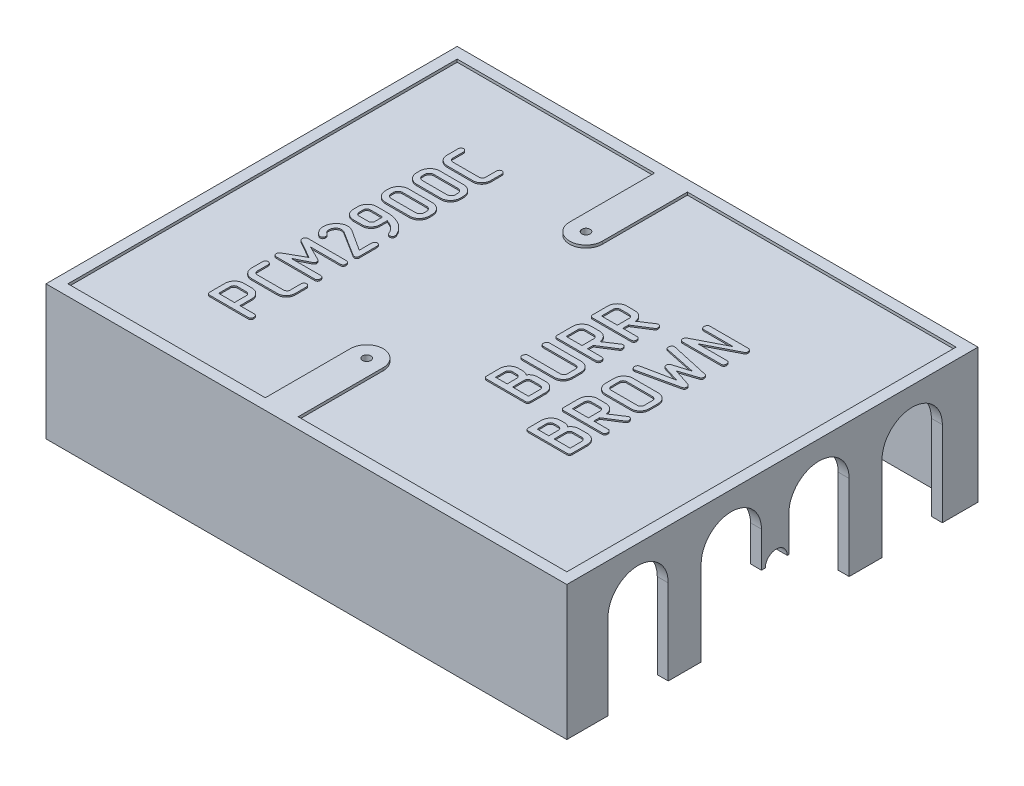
from build123d import *

# Parameters (mm, degrees)
SKETCH_1_W               = 95
SKETCH_1_H               = 75
EXTRUDE_1_DEPTH          = 24
SHELL_1_T                = -2
CUT_EXTRUDE_1_REACH      = 106.915
CUT_EXTRUDE_3_REACH      = 106.915
CUT_EXTRUDE_5_REACH      = 67.104
SKETCH_6_R               = 0.75
SKETCH_4_W               = 95
SKETCH_4_H               = 75
EXTRUDE_3_DEPTH          = 0.5
EXTRUDE_2_DEPTH          = 0.25
CUT_EXTRUDE_START        = -41.5
CUT_EXTRUDE_6_DEPTH      = 12
CUT_EXTRUDE_7_DEPTH      = 66.103763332
CUT_EXTRUDE_7_DEPTH_BACK = 66.103763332
SKETCH_6_2_R             = 0.75
CUT_EXTRUDE_START_2      = -37.5
CUT_EXTRUDE_8_DEPTH      = 6


with BuildPart() as part:
    # Sketch 1 → Extrude 1 (new body)
    with BuildSketch(Plane(origin=(0, 0, 0), x_dir=(1, 0, 0), z_dir=(0, 1, 0))):
        Rectangle(SKETCH_1_W, SKETCH_1_H)
    extrude(amount=EXTRUDE_1_DEPTH)

    # Shell 1
    shell_1_openings = [part.faces().sort_by_distance(p)[0] for p in [
        (0, 0, 0),
    ]]
    offset(amount=SHELL_1_T, openings=shell_1_openings, kind=Kind.INTERSECTION)

    # Sketch 2 → Cut-Extrude 1 (cut, up to next)
    with BuildSketch(Plane(origin=(47.5, 0, 0), x_dir=(0, 0, -1), z_dir=(1, 0, 0)), mode=Mode.PRIVATE) as cut_extrude_1_sk1:
        with BuildLine():
            Line((-30, 15.5), (-30, 0))
            Line((-30, 0), (-19, 0))
            Line((-19, 0), (-19, 15.5))
            ThreePointArc((-19, 15.5), (-24.5, 21), (-30, 15.5))
        make_face()
    cut_extrude_1_tool1 = extrude(cut_extrude_1_sk1.sketch, amount=-CUT_EXTRUDE_1_REACH, mode=Mode.PRIVATE) & part.part
    # Sketch 2 → Cut-Extrude 1 (cut, up to next)
    with BuildSketch(Plane(origin=(47.5, 0, 0), x_dir=(0, 0, -1), z_dir=(1, 0, 0)), mode=Mode.PRIVATE) as cut_extrude_1_sk2:
        with BuildLine():
            Line((-13, 15.5), (-13, 0))
            Line((-13, 0), (-2, 0))
            Line((-2, 0), (-2, 15.5))
            ThreePointArc((-2, 15.5), (-7.5, 21), (-13, 15.5))
        make_face()
    cut_extrude_1_tool2 = extrude(cut_extrude_1_sk2.sketch, amount=-CUT_EXTRUDE_1_REACH, mode=Mode.PRIVATE) & part.part
    # Sketch 2 → Cut-Extrude 1 (cut, up to next)
    with BuildSketch(Plane(origin=(47.5, 0, 0), x_dir=(0, 0, -1), z_dir=(1, 0, 0)), mode=Mode.PRIVATE) as cut_extrude_1_sk3:
        with BuildLine():
            Line((3, 15.5), (3, 0))
            Line((3, 0), (14, 0))
            Line((14, 0), (14, 15.5))
            ThreePointArc((14, 15.5), (8.5, 21), (3, 15.5))
        make_face()
    cut_extrude_1_tool3 = extrude(cut_extrude_1_sk3.sketch, amount=-CUT_EXTRUDE_1_REACH, mode=Mode.PRIVATE) & part.part
    # Sketch 2 → Cut-Extrude 1 (cut, up to next)
    with BuildSketch(Plane(origin=(47.5, 0, 0), x_dir=(0, 0, -1), z_dir=(1, 0, 0)), mode=Mode.PRIVATE) as cut_extrude_1_sk4:
        with BuildLine():
            Line((20, 15.5), (20, 0))
            Line((20, 0), (31, 0))
            Line((31, 0), (31, 15.5))
            ThreePointArc((31, 15.5), (25.5, 21), (20, 15.5))
        make_face()
    cut_extrude_1_tool4 = extrude(cut_extrude_1_sk4.sketch, amount=-CUT_EXTRUDE_1_REACH, mode=Mode.PRIVATE) & part.part
    add(cut_extrude_1_tool1.solids().sort_by_distance((47.5, 9.947861, 24.5))[0], mode=Mode.SUBTRACT)
    add(cut_extrude_1_tool2.solids().sort_by_distance((47.5, 9.947861, 7.5))[0], mode=Mode.SUBTRACT)
    add(cut_extrude_1_tool3.solids().sort_by_distance((47.5, 9.947861, -8.5))[0], mode=Mode.SUBTRACT)
    add(cut_extrude_1_tool4.solids().sort_by_distance((47.5, 9.947861, -25.5))[0], mode=Mode.SUBTRACT)

    # Sketch 3 → Cut-Extrude 3 (cut, up to next)
    with BuildSketch(Plane(origin=(47.5, 0, 0), x_dir=(0, 0, -1), z_dir=(1, 0, 0)), mode=Mode.PRIVATE) as cut_extrude_3_sk1:
        with BuildLine():
            Line((2.7, 9), (3, 9))
            Line((3, 9), (3, 0))
            Line((3, 0), (-2, 0))
            Line((-2, 0), (-2, 9))
            Line((-2, 9), (-1.3, 9))
            ThreePointArc((-1.3, 9), (0.7, 11), (2.7, 9))
        make_face()
    cut_extrude_3_tool1 = extrude(cut_extrude_3_sk1.sketch, amount=-CUT_EXTRUDE_3_REACH, mode=Mode.PRIVATE) & part.part
    add(cut_extrude_3_tool1.solids().sort_by_distance((47.5, 5.155335, -0.524504))[0], mode=Mode.SUBTRACT)

    # Sketch 6 → Cut-Extrude 5 (cut, up to next)
    with BuildSketch(Plane(origin=(0, 24, 0), x_dir=(1, 0, 0), z_dir=(0, 1, 0)), mode=Mode.PRIVATE) as cut_extrude_5_sk1:
        with Locations(Location((-6.5, 20, 0), (0, 0, 270))):
            Circle(SKETCH_6_R)
    cut_extrude_5_tool1 = extrude(cut_extrude_5_sk1.sketch, amount=-CUT_EXTRUDE_5_REACH, mode=Mode.PRIVATE) & part.part
    # Sketch 6 → Cut-Extrude 5 (cut, up to next)
    with BuildSketch(Plane(origin=(0, 24, 0), x_dir=(1, 0, 0), z_dir=(0, 1, 0)), mode=Mode.PRIVATE) as cut_extrude_5_sk2:
        with Locations(Location((-6.5, -20, 0), (0, 0, 270))):
            Circle(SKETCH_6_R)
    cut_extrude_5_tool2 = extrude(cut_extrude_5_sk2.sketch, amount=-CUT_EXTRUDE_5_REACH, mode=Mode.PRIVATE) & part.part
    add(cut_extrude_5_tool1.solids().sort_by_distance((-6.5, 24, -20))[0], mode=Mode.SUBTRACT)
    add(cut_extrude_5_tool2.solids().sort_by_distance((-6.5, 24, 20))[0], mode=Mode.SUBTRACT)

    # Sketch 4 → Extrude 3 (add)
    with BuildSketch(Plane(origin=(0, 24, 0), x_dir=(1, 0, 0), z_dir=(0, 1, 0))):
        Rectangle(SKETCH_4_W, SKETCH_4_H)
        with BuildLine():
            Line((45.5, 35.5), (-3.5, 35.5))
            Line((-3.5, 35.5), (-3.5, 20))
            ThreePointArc((-3.5, 20), (-6.5, 17), (-9.5, 20))
            Line((-9.5, 20), (-9.5, 35.5))
            Line((-9.5, 35.5), (-45.5, 35.5))
            Line((-45.5, 35.5), (-45.5, -35.5))
            Line((-45.5, -35.5), (-9.5, -35.5))
            Line((-9.5, -35.5), (-9.5, -20))
            ThreePointArc((-9.5, -20), (-6.5, -17), (-3.5, -20))
            Line((-3.5, -20), (-3.5, -35.5))
            Line((-3.5, -35.5), (45.5, -35.5))
            Line((45.5, -35.5), (45.5, 35.5))
        make_face(mode=Mode.SUBTRACT)
    extrude(amount=EXTRUDE_3_DEPTH)

    # Sketch 7 → Extrude 2 (add)
    # profile 1 of 17: a face of its own
    with BuildSketch(Plane(origin=(0, 24, 0), x_dir=(1, 0, 0), z_dir=(0, 1, 0))):
        with BuildLine():
            add(Edge.make_bspline(
                [(-23.5, 21.588926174), (-23.501520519, 21.637234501), (-23.504388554, 21.728354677), (-23.536479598, 21.855370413), (-23.589925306, 21.962706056), (-23.666066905, 22.045031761), (-23.748690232, 22.106679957), (-23.831058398, 22.154042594), (-23.912834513, 22.184820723), (-23.968449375, 22.188055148), (-23.994966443, 22.189597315)],
                knots=[0, 0, 0, 0, 1.338544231, 2.524790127, 3.608106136, 4.630632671, 5.605730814, 6.46082919, 7.266126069, 8, 8, 8, 8], degree=3))
            add(Edge.make_bspline(
                [(-23.994966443, 22.189597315), (-24.02427003, 22.18814103), (-24.083021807, 22.185221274), (-24.16954125, 22.155788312), (-24.253012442, 22.109907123), (-24.334462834, 22.048634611), (-24.404779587, 21.965742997), (-24.453523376, 21.858565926), (-24.483607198, 21.730944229), (-24.486638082, 21.638333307), (-24.488255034, 21.588926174)],
                knots=[0, 0, 0, 0, 0.805340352, 1.614654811, 2.490670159, 3.424974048, 4.409924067, 5.451174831, 6.640223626, 8, 8, 8, 8], degree=3))
            Line((-24.488255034, 21.588926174), (-24.488255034, 19.64261745))
            add(Edge.make_bspline(
                [(-24.488255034, 19.64261745), (-24.490500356, 19.607624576), (-24.494953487, 19.538223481), (-24.531966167, 19.437620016), (-24.587171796, 19.340978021), (-24.666535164, 19.253232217), (-24.764006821, 19.176311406), (-24.882337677, 19.120117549), (-25.019133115, 19.089102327), (-25.115615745, 19.084580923), (-25.166107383, 19.082214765)],
                knots=[0, 0, 0, 0, 0.856413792, 1.698518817, 2.602555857, 3.574870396, 4.582487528, 5.632318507, 6.760936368, 8, 8, 8, 8], degree=3))
            Line((-25.166107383, 19.082214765), (-29.833892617, 19.082214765))
            add(Edge.make_bspline(
                [(-29.833892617, 19.082214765), (-29.883819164, 19.084584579), (-29.979185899, 19.089111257), (-30.114449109, 19.120054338), (-30.230788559, 19.176550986), (-30.327827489, 19.252612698), (-30.401241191, 19.343512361), (-30.459537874, 19.437805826), (-30.492257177, 19.539329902), (-30.497427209, 19.608296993), (-30.5, 19.64261745)],
                knots=[0, 0, 0, 0, 1.236899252, 2.362651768, 3.409870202, 4.416049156, 5.38994518, 6.290517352, 7.149301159, 8, 8, 8, 8], degree=3))
            Line((-30.5, 19.64261745), (-30.5, 21.588926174))
            add(Edge.make_bspline(
                [(-30.5, 21.588926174), (-30.501520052, 21.637235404), (-30.504387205, 21.728357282), (-30.536484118, 21.855361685), (-30.589910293, 21.962735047), (-30.666118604, 22.044931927), (-30.748908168, 22.107311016), (-30.83201563, 22.153176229), (-30.913268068, 22.185105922), (-30.968418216, 22.188137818), (-30.994966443, 22.189597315)],
                knots=[0, 0, 0, 0, 1.338726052, 2.525133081, 3.608596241, 4.631261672, 5.606492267, 6.475274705, 7.266026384, 8, 8, 8, 8], degree=3))
            add(Edge.make_bspline(
                [(-30.994966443, 22.189597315), (-31.02427874, 22.188127), (-31.083582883, 22.185152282), (-31.170662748, 22.155462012), (-31.256972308, 22.112160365), (-31.338635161, 22.049735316), (-31.414389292, 21.969595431), (-31.46289921, 21.860569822), (-31.496131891, 21.732414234), (-31.498650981, 21.638968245), (-31.5, 21.588926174)],
                knots=[0, 0, 0, 0, 0.797207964, 1.612897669, 2.486488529, 3.423490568, 4.406937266, 5.458032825, 6.638729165, 8, 8, 8, 8], degree=3))
            Line((-31.5, 21.588926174), (-31.5, 19.64261745))
            add(Edge.make_bspline(
                [(-31.5, 19.64261745), (-31.498146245, 19.585514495), (-31.494515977, 19.47368794), (-31.473035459, 19.308705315), (-31.43345922, 19.151275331), (-31.382256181, 18.998737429), (-31.312655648, 18.853922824), (-31.227494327, 18.716182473), (-31.131114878, 18.582172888), (-31.016368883, 18.460119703), (-30.893833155, 18.345513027), (-30.760803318, 18.247323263), (-30.623013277, 18.161736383), (-30.47697254, 18.095116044), (-30.325665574, 18.040739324), (-30.167736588, 18.001980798), (-30.002840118, 17.980267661), (-29.891001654, 17.976669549), (-29.833892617, 17.974832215)],
                knots=[0, 0, 0, 0, 1.04470388, 2.045877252, 3.035855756, 4.009633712, 4.984271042, 5.966768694, 6.969352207, 7.997445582, 9.025538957, 10.0342103, 11.016707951, 11.986986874, 12.964144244, 13.954122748, 14.95529612, 16, 16, 16, 16], degree=3))
            Line((-29.833892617, 17.974832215), (-25.166107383, 17.974832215))
            add(Edge.make_bspline(
                [(-25.166107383, 17.974832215), (-25.108443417, 17.976701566), (-24.994944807, 17.980380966), (-24.827782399, 18.001795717), (-24.667638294, 18.040732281), (-24.514706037, 18.095171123), (-24.367243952, 18.161267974), (-24.229238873, 18.247459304), (-24.095760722, 18.345161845), (-24.015397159, 18.422414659), (-23.974832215, 18.461409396)],
                knots=[0, 0, 0, 0, 1.046818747, 2.060428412, 3.052666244, 4.031888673, 5.003928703, 5.978879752, 6.97980345, 8, 8, 8, 8], degree=3))
            add(Edge.make_bspline(
                [(-23.974832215, 18.461409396), (-23.937098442, 18.502095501), (-23.862069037, 18.58299529), (-23.765312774, 18.715202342), (-23.684189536, 18.854517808), (-23.616446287, 18.999096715), (-23.564080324, 19.150967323), (-23.52822326, 19.309141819), (-23.502638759, 19.473447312), (-23.500891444, 19.585467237), (-23.5, 19.64261745)],
                knots=[0, 0, 0, 0, 1.018507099, 2.025187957, 3.001163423, 3.975407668, 4.953165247, 5.9447985, 6.951479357, 8, 8, 8, 8], degree=3))
            Line((-23.5, 19.64261745), (-23.5, 21.588926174))
        make_face()
    # profile 2 of 17: a face of its own
    with BuildSketch(Plane(origin=(0, 24, 0), x_dir=(1, 0, 0), z_dir=(0, 1, 0))):
        with BuildLine():
            Line((-25.315436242, 16.498322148), (-29.674496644, 16.498322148))
            add(Edge.make_bspline(
                [(-29.674496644, 16.498322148), (-29.734423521, 16.496730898), (-29.852581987, 16.493593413), (-30.027095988, 16.46798881), (-30.195578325, 16.423864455), (-30.359110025, 16.3631102), (-30.517302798, 16.285935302), (-30.669014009, 16.190681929), (-30.816056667, 16.080058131), (-30.952992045, 15.950748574), (-31.082798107, 15.812308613), (-31.192761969, 15.660145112), (-31.288494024, 15.501329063), (-31.365452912, 15.332844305), (-31.426056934, 15.155797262), (-31.46998995, 14.970471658), (-31.495283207, 14.776433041), (-31.498409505, 14.644368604), (-31.5, 14.577181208)],
                knots=[0, 0, 0, 0, 0.975884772, 1.924162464, 2.865500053, 3.808115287, 4.761543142, 5.727253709, 6.72213282, 7.753590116, 8.791744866, 9.80853288, 10.805370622, 11.808185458, 12.819448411, 13.849214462, 14.905794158, 16, 16, 16, 16], degree=3))
            Line((-31.5, 14.577181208), (-31.5, 14.110738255))
            add(Edge.make_bspline(
                [(-31.5, 14.110738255), (-31.498401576, 14.04913829), (-31.495249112, 13.927648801), (-31.469736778, 13.748099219), (-31.425633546, 13.575931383), (-31.366946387, 13.408984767), (-31.289315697, 13.250380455), (-31.195956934, 13.097290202), (-31.085327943, 12.950958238), (-30.999788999, 12.861061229), (-30.956375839, 12.815436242)],
                knots=[0, 0, 0, 0, 1.024038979, 2.019643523, 3.007574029, 3.97533876, 4.956945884, 5.937847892, 6.953406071, 8, 8, 8, 8], degree=3))
            add(Edge.make_bspline(
                [(-30.956375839, 12.815436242), (-30.911847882, 12.77316433), (-30.823568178, 12.68935739), (-30.679542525, 12.580869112), (-30.528115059, 12.489185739), (-30.371168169, 12.413259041), (-30.205912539, 12.356122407), (-30.035236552, 12.314260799), (-29.857066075, 12.288104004), (-29.736108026, 12.2850915), (-29.674496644, 12.283557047)],
                knots=[0, 0, 0, 0, 1.032819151, 2.047634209, 3.027619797, 4.00868994, 4.976298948, 5.964927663, 6.963412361, 8, 8, 8, 8], degree=3))
            Line((-29.674496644, 12.283557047), (-25.315436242, 12.283557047))
            add(Edge.make_bspline(
                [(-25.315436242, 12.283557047), (-25.252712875, 12.285110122), (-25.129540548, 12.288159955), (-24.948501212, 12.313987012), (-24.775250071, 12.356546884), (-24.607815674, 12.412400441), (-24.449840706, 12.48976317), (-24.297182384, 12.580290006), (-24.152985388, 12.689432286), (-24.06467677, 12.773189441), (-24.020134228, 12.815436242)],
                knots=[0, 0, 0, 0, 1.045924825, 2.05392348, 3.042743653, 4.019296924, 4.991562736, 5.970741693, 6.976449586, 8, 8, 8, 8], degree=3))
            add(Edge.make_bspline(
                [(-24.020134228, 12.815436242), (-23.978305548, 12.859885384), (-23.89558208, 12.94779127), (-23.790225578, 13.093127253), (-23.70055915, 13.245457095), (-23.626124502, 13.404075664), (-23.571458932, 13.571296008), (-23.528144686, 13.743642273), (-23.505196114, 13.924999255), (-23.501753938, 14.048042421), (-23.5, 14.110738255)],
                knots=[0, 0, 0, 0, 1.021212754, 2.019625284, 2.997803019, 3.978309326, 4.946754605, 5.939396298, 6.950032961, 8, 8, 8, 8], degree=3))
            Line((-23.5, 14.110738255), (-23.5, 14.577181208))
            add(Edge.make_bspline(
                [(-23.5, 14.577181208), (-23.501761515, 14.645461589), (-23.505208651, 14.77908057), (-23.527785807, 14.974973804), (-23.571378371, 15.159575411), (-23.625083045, 15.336086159), (-23.700226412, 15.500713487), (-23.789845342, 15.656447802), (-23.894634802, 15.803559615), (-23.97818677, 15.890776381), (-24.020134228, 15.934563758)],
                knots=[0, 0, 0, 0, 1.097335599, 2.147393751, 3.161174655, 4.14174761, 5.107171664, 6.061361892, 7.026702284, 8, 8, 8, 8], degree=3))
            add(Edge.make_bspline(
                [(-24.020134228, 15.934563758), (-24.067460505, 15.979627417), (-24.159857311, 16.067606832), (-24.309371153, 16.182688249), (-24.463483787, 16.280638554), (-24.624121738, 16.359557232), (-24.788983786, 16.422713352), (-24.960234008, 16.465840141), (-25.136088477, 16.493982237), (-25.255484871, 16.496871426), (-25.315436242, 16.498322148)],
                knots=[0, 0, 0, 0, 1.079886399, 2.108301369, 3.114014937, 4.094149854, 5.062832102, 6.027267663, 7.009450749, 8, 8, 8, 8], degree=3))
        make_face()
        with BuildLine():
            add(Edge.make_bspline(
                [(-25.315436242, 15.402684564), (-25.260325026, 15.399872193), (-25.152057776, 15.394347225), (-24.995851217, 15.347770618), (-24.854586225, 15.267806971), (-24.727822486, 15.163124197), (-24.623097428, 15.036360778), (-24.54356202, 14.895522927), (-24.496364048, 14.740079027), (-24.4909994, 14.63231137), (-24.488255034, 14.577181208)],
                knots=[0, 0, 0, 0, 1.018588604, 2.001040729, 2.983220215, 4.004959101, 5.026697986, 6.008877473, 6.981411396, 8, 8, 8, 8], degree=3))
            Line((-24.488255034, 14.577181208), (-24.488255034, 14.110738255))
            add(Edge.make_bspline(
                [(-24.488255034, 14.110738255), (-24.490612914, 14.066738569), (-24.495386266, 13.977664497), (-24.542351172, 13.848857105), (-24.614561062, 13.725598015), (-24.712908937, 13.611541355), (-24.833178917, 13.511704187), (-24.978452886, 13.442248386), (-25.140445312, 13.39694953), (-25.255826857, 13.392986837), (-25.315436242, 13.390939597)],
                knots=[0, 0, 0, 0, 0.865121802, 1.75137437, 2.671061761, 3.672736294, 4.708351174, 5.729762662, 6.827130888, 8, 8, 8, 8], degree=3))
            Line((-25.315436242, 13.390939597), (-29.674496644, 13.390939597))
            add(Edge.make_bspline(
                [(-29.674496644, 13.390939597), (-29.734113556, 13.392940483), (-29.84896854, 13.396795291), (-30.011088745, 13.442588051), (-30.156073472, 13.513140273), (-30.276896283, 13.613242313), (-30.375750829, 13.726761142), (-30.445157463, 13.850632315), (-30.49320943, 13.978069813), (-30.497745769, 14.066696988), (-30.5, 14.110738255)],
                knots=[0, 0, 0, 0, 1.174601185, 2.262928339, 3.300661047, 4.337805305, 5.340959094, 6.256486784, 7.133600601, 8, 8, 8, 8], degree=3))
            Line((-30.5, 14.110738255), (-30.5, 14.577181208))
            add(Edge.make_bspline(
                [(-30.5, 14.577181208), (-30.497180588, 14.6317494), (-30.491613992, 14.739487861), (-30.444710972, 14.894574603), (-30.367143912, 15.036857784), (-30.261942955, 15.162974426), (-30.135142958, 15.268420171), (-29.993149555, 15.346946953), (-29.837437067, 15.394650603), (-29.729641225, 15.399965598), (-29.674496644, 15.402684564)],
                knots=[0, 0, 0, 0, 1.009066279, 1.99228238, 2.970246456, 3.992779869, 5.015313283, 6.00732913, 6.980619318, 8, 8, 8, 8], degree=3))
            Line((-29.674496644, 15.402684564), (-25.315436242, 15.402684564))
        make_face(mode=Mode.SUBTRACT)
    # profile 3 of 17: a face of its own
    with BuildSketch(Plane(origin=(0, 24, 0), x_dir=(1, 0, 0), z_dir=(0, 1, 0))):
        with BuildLine():
            Line((-25.315436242, 10.80704698), (-29.674496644, 10.80704698))
            add(Edge.make_bspline(
                [(-29.674496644, 10.80704698), (-29.734423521, 10.80545573), (-29.852581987, 10.802318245), (-30.027095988, 10.776713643), (-30.195578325, 10.732589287), (-30.359110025, 10.671835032), (-30.517302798, 10.594660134), (-30.669014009, 10.499406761), (-30.816056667, 10.388782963), (-30.952992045, 10.259473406), (-31.082798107, 10.121033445), (-31.192761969, 9.968869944), (-31.288494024, 9.810053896), (-31.365452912, 9.641569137), (-31.426056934, 9.464522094), (-31.46998995, 9.27919649), (-31.495283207, 9.085157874), (-31.498409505, 8.953093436), (-31.5, 8.88590604)],
                knots=[0, 0, 0, 0, 0.975884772, 1.924162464, 2.865500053, 3.808115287, 4.761543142, 5.727253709, 6.72213282, 7.753590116, 8.791744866, 9.80853288, 10.805370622, 11.808185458, 12.819448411, 13.849214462, 14.905794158, 16, 16, 16, 16], degree=3))
            Line((-31.5, 8.88590604), (-31.5, 8.419463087))
            add(Edge.make_bspline(
                [(-31.5, 8.419463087), (-31.498401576, 8.357863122), (-31.495249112, 8.236373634), (-31.469736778, 8.056824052), (-31.425633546, 7.884656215), (-31.366946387, 7.717709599), (-31.289315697, 7.559105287), (-31.195956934, 7.406015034), (-31.085327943, 7.25968307), (-30.999788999, 7.169786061), (-30.956375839, 7.124161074)],
                knots=[0, 0, 0, 0, 1.024038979, 2.019643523, 3.007574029, 3.97533876, 4.956945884, 5.937847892, 6.953406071, 8, 8, 8, 8], degree=3))
            add(Edge.make_bspline(
                [(-30.956375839, 7.124161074), (-30.911847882, 7.081889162), (-30.823568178, 6.998082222), (-30.679542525, 6.889593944), (-30.528115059, 6.797910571), (-30.371168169, 6.721983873), (-30.205912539, 6.664847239), (-30.035236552, 6.622985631), (-29.857066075, 6.596828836), (-29.736108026, 6.593816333), (-29.674496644, 6.592281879)],
                knots=[0, 0, 0, 0, 1.032819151, 2.047634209, 3.027619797, 4.00868994, 4.976298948, 5.964927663, 6.963412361, 8, 8, 8, 8], degree=3))
            Line((-29.674496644, 6.592281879), (-25.315436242, 6.592281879))
            add(Edge.make_bspline(
                [(-25.315436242, 6.592281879), (-25.252712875, 6.593834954), (-25.129540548, 6.596884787), (-24.948501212, 6.622711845), (-24.775250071, 6.665271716), (-24.607815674, 6.721125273), (-24.449840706, 6.798488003), (-24.297182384, 6.889014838), (-24.152985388, 6.998157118), (-24.06467677, 7.081914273), (-24.020134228, 7.124161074)],
                knots=[0, 0, 0, 0, 1.045924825, 2.05392348, 3.042743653, 4.019296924, 4.991562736, 5.970741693, 6.976449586, 8, 8, 8, 8], degree=3))
            add(Edge.make_bspline(
                [(-24.020134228, 7.124161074), (-23.978305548, 7.168610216), (-23.89558208, 7.256516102), (-23.790225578, 7.401852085), (-23.70055915, 7.554181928), (-23.626124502, 7.712800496), (-23.571458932, 7.88002084), (-23.528144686, 8.052367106), (-23.505196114, 8.233724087), (-23.501753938, 8.356767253), (-23.5, 8.419463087)],
                knots=[0, 0, 0, 0, 1.021212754, 2.019625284, 2.997803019, 3.978309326, 4.946754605, 5.939396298, 6.950032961, 8, 8, 8, 8], degree=3))
            Line((-23.5, 8.419463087), (-23.5, 8.88590604))
            add(Edge.make_bspline(
                [(-23.5, 8.88590604), (-23.501761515, 8.954186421), (-23.505208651, 9.087805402), (-23.527785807, 9.283698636), (-23.571378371, 9.468300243), (-23.625083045, 9.644810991), (-23.700226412, 9.809438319), (-23.789845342, 9.965172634), (-23.894634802, 10.112284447), (-23.97818677, 10.199501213), (-24.020134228, 10.243288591)],
                knots=[0, 0, 0, 0, 1.097335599, 2.147393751, 3.161174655, 4.14174761, 5.107171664, 6.061361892, 7.026702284, 8, 8, 8, 8], degree=3))
            add(Edge.make_bspline(
                [(-24.020134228, 10.243288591), (-24.067460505, 10.288352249), (-24.159857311, 10.376331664), (-24.309371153, 10.491413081), (-24.463483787, 10.589363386), (-24.624121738, 10.668282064), (-24.788983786, 10.731438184), (-24.960234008, 10.774564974), (-25.136088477, 10.802707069), (-25.255484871, 10.805596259), (-25.315436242, 10.80704698)],
                knots=[0, 0, 0, 0, 1.079886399, 2.108301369, 3.114014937, 4.094149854, 5.062832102, 6.027267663, 7.009450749, 8, 8, 8, 8], degree=3))
        make_face()
        with BuildLine():
            add(Edge.make_bspline(
                [(-25.315436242, 9.711409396), (-25.260325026, 9.708597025), (-25.152057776, 9.703072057), (-24.995851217, 9.65649545), (-24.854586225, 9.576531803), (-24.727822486, 9.471849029), (-24.623097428, 9.34508561), (-24.54356202, 9.20424776), (-24.496364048, 9.048803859), (-24.4909994, 8.941036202), (-24.488255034, 8.88590604)],
                knots=[0, 0, 0, 0, 1.018588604, 2.001040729, 2.983220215, 4.004959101, 5.026697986, 6.008877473, 6.981411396, 8, 8, 8, 8], degree=3))
            Line((-24.488255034, 8.88590604), (-24.488255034, 8.419463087))
            add(Edge.make_bspline(
                [(-24.488255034, 8.419463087), (-24.490612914, 8.375463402), (-24.495386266, 8.28638933), (-24.542351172, 8.157581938), (-24.614561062, 8.034322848), (-24.712908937, 7.920266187), (-24.833178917, 7.820429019), (-24.978452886, 7.750973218), (-25.140445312, 7.705674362), (-25.255826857, 7.701711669), (-25.315436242, 7.69966443)],
                knots=[0, 0, 0, 0, 0.865121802, 1.75137437, 2.671061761, 3.672736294, 4.708351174, 5.729762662, 6.827130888, 8, 8, 8, 8], degree=3))
            Line((-25.315436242, 7.69966443), (-29.674496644, 7.69966443))
            add(Edge.make_bspline(
                [(-29.674496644, 7.69966443), (-29.734113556, 7.701665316), (-29.84896854, 7.705520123), (-30.011088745, 7.751312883), (-30.156073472, 7.821865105), (-30.276896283, 7.921967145), (-30.375750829, 8.035485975), (-30.445157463, 8.159357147), (-30.49320943, 8.286794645), (-30.497745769, 8.37542182), (-30.5, 8.419463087)],
                knots=[0, 0, 0, 0, 1.174601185, 2.262928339, 3.300661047, 4.337805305, 5.340959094, 6.256486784, 7.133600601, 8, 8, 8, 8], degree=3))
            Line((-30.5, 8.419463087), (-30.5, 8.88590604))
            add(Edge.make_bspline(
                [(-30.5, 8.88590604), (-30.497180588, 8.940474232), (-30.491613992, 9.048212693), (-30.444710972, 9.203299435), (-30.367143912, 9.345582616), (-30.261942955, 9.471699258), (-30.135142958, 9.577145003), (-29.993149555, 9.655671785), (-29.837437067, 9.703375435), (-29.729641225, 9.70869043), (-29.674496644, 9.711409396)],
                knots=[0, 0, 0, 0, 1.009066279, 1.99228238, 2.970246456, 3.992779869, 5.015313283, 6.00732913, 6.980619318, 8, 8, 8, 8], degree=3))
            Line((-29.674496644, 9.711409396), (-25.315436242, 9.711409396))
        make_face(mode=Mode.SUBTRACT)
    # profile 4 of 17: a face of its own
    with BuildSketch(Plane(origin=(0, 24, 0), x_dir=(1, 0, 0), z_dir=(0, 1, 0))):
        with BuildLine():
            add(Edge.make_bspline(
                [(-26.60738255, 3.872483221), (-26.601645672, 3.864734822), (-26.587588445, 3.845748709), (-26.54850329, 3.826908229), (-26.499762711, 3.798027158), (-26.408724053, 3.765383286), (-26.287121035, 3.72035442), (-26.188447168, 3.681913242), (-26.139261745, 3.662751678)],
                knots=[0, 0, 0, 0, 0.331666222, 0.812690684, 1.474878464, 2.313935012, 4.162627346, 6, 6, 6, 6], degree=3))
            add(Edge.make_bspline(
                [(-26.139261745, 3.662751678), (-26.043358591, 3.620262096), (-25.853476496, 3.536135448), (-25.585421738, 3.381345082), (-25.339174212, 3.200483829), (-25.114503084, 2.996892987), (-24.910365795, 2.774552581), (-24.734604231, 2.530532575), (-24.579300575, 2.272115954), (-24.498609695, 2.087670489), (-24.458053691, 1.994966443)],
                knots=[0, 0, 0, 0, 1.033996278, 2.047246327, 3.045674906, 4.041540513, 5.033319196, 6.016331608, 7.002989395, 8, 8, 8, 8], degree=3))
            add(Edge.make_bspline(
                [(-24.458053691, 1.994966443), (-24.447597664, 1.969451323), (-24.427598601, 1.920648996), (-24.386548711, 1.854706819), (-24.336078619, 1.800850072), (-24.259322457, 1.745360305), (-24.152600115, 1.697526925), (-24.061474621, 1.689955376), (-24.016778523, 1.686241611)],
                knots=[0, 0, 0, 0, 0.86173907, 1.648233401, 2.415811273, 3.154313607, 4.604220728, 6, 6, 6, 6], degree=3))
            add(Edge.make_bspline(
                [(-24.016778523, 1.686241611), (-23.98422036, 1.687928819), (-23.91923881, 1.691296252), (-23.824376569, 1.716109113), (-23.737594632, 1.762770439), (-23.65526952, 1.819192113), (-23.58750392, 1.892983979), (-23.534967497, 1.975894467), (-23.505742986, 2.070285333), (-23.501954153, 2.135716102), (-23.5, 2.169463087)],
                knots=[0, 0, 0, 0, 0.994793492, 1.985468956, 2.963686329, 3.992676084, 5.020388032, 6.002180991, 6.969592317, 8, 8, 8, 8], degree=3))
            add(Edge.make_bspline(
                [(-23.5, 2.169463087), (-23.501272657, 2.221029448), (-23.503633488, 2.316687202), (-23.539046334, 2.405412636), (-23.555369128, 2.446308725)],
                knots=[0, 0, 0, 0, 1.078142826, 2, 2, 2, 2], degree=3))
            add(Edge.make_bspline(
                [(-23.555369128, 2.446308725), (-23.611002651, 2.572293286), (-23.721272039, 2.822003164), (-23.931023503, 3.173522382), (-24.173076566, 3.501872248), (-24.448050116, 3.804160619), (-24.746739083, 4.077678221), (-25.063336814, 4.319959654), (-25.398055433, 4.524923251), (-25.634161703, 4.632632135), (-25.751677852, 4.686241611)],
                knots=[0, 0, 0, 0, 1.026837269, 2.035260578, 3.0468565, 4.066135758, 5.079245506, 6.064962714, 7.036882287, 8, 8, 8, 8], degree=3))
            add(Edge.make_bspline(
                [(-25.751677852, 4.686241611), (-25.836348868, 4.720694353), (-26.005239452, 4.789416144), (-26.264703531, 4.876474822), (-26.527446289, 4.949928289), (-26.794414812, 5.011137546), (-27.065026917, 5.057523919), (-27.339924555, 5.091252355), (-27.618248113, 5.111926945), (-27.805334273, 5.114486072), (-27.899328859, 5.115771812)],
                knots=[0, 0, 0, 0, 0.994786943, 1.984269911, 2.976837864, 3.963320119, 4.964123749, 5.963834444, 6.977003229, 8, 8, 8, 8], degree=3))
            Line((-27.899328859, 5.115771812), (-29.833892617, 5.115771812))
            add(Edge.make_bspline(
                [(-29.833892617, 5.115771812), (-29.888217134, 5.11400985), (-29.996249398, 5.110505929), (-30.155613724, 5.087042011), (-30.310208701, 5.046115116), (-30.460356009, 4.988675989), (-30.606157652, 4.914416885), (-30.748073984, 4.825083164), (-30.884338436, 4.719038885), (-30.968799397, 4.638345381), (-31.011744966, 4.597315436)],
                knots=[0, 0, 0, 0, 0.985925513, 1.960657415, 2.915956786, 3.883047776, 4.872676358, 5.880871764, 6.92249427, 8, 8, 8, 8], degree=3))
            add(Edge.make_bspline(
                [(-31.011744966, 4.597315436), (-31.050670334, 4.556709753), (-31.127785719, 4.47626548), (-31.227356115, 4.342219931), (-31.311261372, 4.199147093), (-31.381221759, 4.046466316), (-31.434053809, 3.883602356), (-31.473420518, 3.711326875), (-31.49443729, 3.529601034), (-31.498121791, 3.405528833), (-31.5, 3.342281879)],
                knots=[0, 0, 0, 0, 0.974289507, 1.930173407, 2.886204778, 3.844984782, 4.835205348, 5.848876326, 6.903444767, 8, 8, 8, 8], degree=3))
            Line((-31.5, 3.342281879), (-31.5, 2.568791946))
            add(Edge.make_bspline(
                [(-31.5, 2.568791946), (-31.498146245, 2.511688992), (-31.494515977, 2.399862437), (-31.473035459, 2.234879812), (-31.43345922, 2.077449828), (-31.382256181, 1.924911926), (-31.312655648, 1.780097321), (-31.227494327, 1.64235697), (-31.131114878, 1.508347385), (-31.016368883, 1.386294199), (-30.893833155, 1.271687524), (-30.760803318, 1.173497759), (-30.623013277, 1.087910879), (-30.47697254, 1.021290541), (-30.325665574, 0.966913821), (-30.167736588, 0.928155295), (-30.002840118, 0.906442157), (-29.891001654, 0.902844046), (-29.833892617, 0.901006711)],
                knots=[0, 0, 0, 0, 1.04470388, 2.045877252, 3.035855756, 4.009633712, 4.984271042, 5.966768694, 6.969352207, 7.997445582, 9.025538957, 10.0342103, 11.016707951, 11.986986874, 12.964144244, 13.954122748, 14.95529612, 16, 16, 16, 16], degree=3))
            Line((-29.833892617, 0.901006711), (-28.273489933, 0.901006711))
            add(Edge.make_bspline(
                [(-28.273489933, 0.901006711), (-28.216387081, 0.902860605), (-28.104560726, 0.906491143), (-27.939576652, 0.927969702), (-27.782152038, 0.967553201), (-27.62959442, 1.018729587), (-27.484853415, 1.088429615), (-27.347217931, 1.172978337), (-27.214612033, 1.270492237), (-27.092598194, 1.384552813), (-26.978129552, 1.507216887), (-26.879685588, 1.64011633), (-26.794827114, 1.778492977), (-26.725095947, 1.92321403), (-26.673945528, 2.075779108), (-26.634152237, 2.233732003), (-26.612980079, 2.399320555), (-26.609268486, 2.511693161), (-26.60738255, 2.568791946)],
                knots=[0, 0, 0, 0, 1.044515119, 2.045507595, 3.035307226, 4.008909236, 4.983370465, 5.965690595, 6.959866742, 7.987774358, 9.015681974, 10.024171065, 11.006491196, 11.980952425, 12.954554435, 13.944354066, 14.955484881, 16, 16, 16, 16], degree=3))
            Line((-26.60738255, 2.568791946), (-26.60738255, 3.872483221))
        make_face()
        with BuildLine():
            Line((-27.60738255, 3.998322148), (-27.60738255, 2.568791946))
            add(Edge.make_bspline(
                [(-27.60738255, 2.568791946), (-27.608894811, 2.533768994), (-27.611896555, 2.4642506), (-27.649794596, 2.364254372), (-27.702648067, 2.267178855), (-27.780589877, 2.179481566), (-27.876315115, 2.102517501), (-27.993015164, 2.046289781), (-28.128173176, 2.015268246), (-28.22355532, 2.010753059), (-28.273489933, 2.008389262)],
                knots=[0, 0, 0, 0, 0.862256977, 1.711526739, 2.616399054, 3.587856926, 4.593145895, 5.639438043, 6.764194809, 8, 8, 8, 8], degree=3))
            Line((-28.273489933, 2.008389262), (-29.833892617, 2.008389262))
            add(Edge.make_bspline(
                [(-29.833892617, 2.008389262), (-29.883819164, 2.010759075), (-29.979185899, 2.015285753), (-30.114449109, 2.046228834), (-30.230788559, 2.102725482), (-30.327827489, 2.178787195), (-30.401241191, 2.269686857), (-30.459537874, 2.363980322), (-30.492257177, 2.465504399), (-30.497427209, 2.53447149), (-30.5, 2.568791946)],
                knots=[0, 0, 0, 0, 1.236899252, 2.362651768, 3.409870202, 4.416049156, 5.38994518, 6.290517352, 7.149301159, 8, 8, 8, 8], degree=3))
            Line((-30.5, 2.568791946), (-30.5, 3.342281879))
            add(Edge.make_bspline(
                [(-30.5, 3.342281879), (-30.497852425, 3.388358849), (-30.493672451, 3.47804165), (-30.457749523, 3.607173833), (-30.39494668, 3.722689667), (-30.313785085, 3.827459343), (-30.211578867, 3.911653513), (-30.096843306, 3.976330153), (-29.968762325, 4.014044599), (-29.879435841, 4.018077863), (-29.833892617, 4.020134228)],
                knots=[0, 0, 0, 0, 1.042310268, 2.028720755, 3.003188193, 4.004046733, 5.011056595, 5.980407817, 6.97030831, 8, 8, 8, 8], degree=3))
            add(Edge.make_bspline(
                [(-29.833892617, 4.020134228), (-29.710290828, 4.020134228), (-29.477069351, 4.020134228), (-29.148210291, 4.020134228), (-28.861856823, 4.020134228), (-28.685123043, 4.020134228), (-28.604026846, 4.020134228)],
                knots=[0, 0, 0, 0, 1.206002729, 2.275579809, 3.208731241, 4, 4, 4, 4], degree=3))
            add(Edge.make_bspline(
                [(-28.604026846, 4.020134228), (-28.536351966, 4.020342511), (-28.409389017, 4.020733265), (-28.232108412, 4.018207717), (-28.080504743, 4.017826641), (-27.953609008, 4.012757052), (-27.848941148, 4.012935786), (-27.764585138, 4.007787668), (-27.699021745, 4.007867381), (-27.63931527, 4.002446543), (-27.582795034, 3.999978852), (-27.541947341, 3.99883776), (-27.523489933, 3.998322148)],
                knots=[0, 0, 0, 0, 1.878198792, 3.523636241, 4.920729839, 6.085316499, 7.047824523, 7.82456037, 8.4301292, 8.86586104, 9.487528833, 10, 10, 10, 10], degree=3))
            Line((-27.523489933, 3.998322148), (-27.60738255, 3.998322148))
        make_face(mode=Mode.SUBTRACT)
    # profile 5 of 17: a face of its own
    with BuildSketch(Plane(origin=(0, 24, 0), x_dir=(1, 0, 0), z_dir=(0, 1, 0))):
        with BuildLine():
            add(Edge.make_bspline(
                [(-28.355704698, -0.874161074), (-28.435932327, -0.833586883), (-28.593734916, -0.753780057), (-28.841780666, -0.669882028), (-29.092454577, -0.619319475), (-29.260400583, -0.612468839), (-29.343959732, -0.609060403)],
                knots=[0, 0, 0, 0, 1.04272758, 2.050978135, 3.030291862, 4, 4, 4, 4], degree=3))
            add(Edge.make_bspline(
                [(-29.343959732, -0.609060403), (-29.413413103, -0.61160504), (-29.551360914, -0.61665918), (-29.755485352, -0.648414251), (-29.95367305, -0.70522412), (-30.14684803, -0.782154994), (-30.334078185, -0.881944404), (-30.515050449, -1.00464335), (-30.691038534, -1.1482792), (-30.800157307, -1.257936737), (-30.855704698, -1.313758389)],
                knots=[0, 0, 0, 0, 0.9710198, 1.928632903, 2.879069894, 3.847442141, 4.83025658, 5.838582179, 6.89972075, 8, 8, 8, 8], degree=3))
            add(Edge.make_bspline(
                [(-30.855704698, -1.313758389), (-30.907231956, -1.370374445), (-31.009251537, -1.482469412), (-31.140626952, -1.667190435), (-31.251634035, -1.862380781), (-31.343042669, -2.068566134), (-31.413342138, -2.285708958), (-31.463635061, -2.513786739), (-31.494447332, -2.752510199), (-31.49812811, -2.915455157), (-31.5, -2.998322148)],
                knots=[0, 0, 0, 0, 0.992146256, 1.96436507, 2.932435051, 3.900178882, 4.8842315, 5.887347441, 6.925593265, 8, 8, 8, 8], degree=3))
            add(Edge.make_bspline(
                [(-31.5, -2.998322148), (-31.496253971, -3.082478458), (-31.488814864, -3.249601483), (-31.434575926, -3.49734482), (-31.344932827, -3.737387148), (-31.222009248, -3.968836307), (-31.070696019, -4.184589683), (-30.895156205, -4.380947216), (-30.701797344, -4.559189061), (-30.556170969, -4.657252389), (-30.483221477, -4.706375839)],
                knots=[0, 0, 0, 0, 0.974558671, 1.935341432, 2.923526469, 3.93512126, 4.963347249, 5.96852999, 6.98236356, 8, 8, 8, 8], degree=3))
            add(Edge.make_bspline(
                [(-30.483221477, -4.706375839), (-30.440625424, -4.730424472), (-30.355602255, -4.77842636), (-30.258290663, -4.786326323), (-30.209731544, -4.790268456)],
                knots=[0, 0, 0, 0, 1.001986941, 2, 2, 2, 2], degree=3))
            add(Edge.make_bspline(
                [(-30.209731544, -4.790268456), (-30.175885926, -4.788551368), (-30.110090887, -4.785213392), (-30.017197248, -4.752653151), (-29.932045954, -4.703888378), (-29.861972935, -4.631982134), (-29.803088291, -4.55206228), (-29.757227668, -4.46676862), (-29.731440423, -4.376210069), (-29.728154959, -4.31446845), (-29.726510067, -4.283557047)],
                knots=[0, 0, 0, 0, 1.044743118, 2.030954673, 3.017470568, 4.058904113, 5.112374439, 6.088797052, 7.04314198, 8, 8, 8, 8], degree=3))
            add(Edge.make_bspline(
                [(-29.726510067, -4.283557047), (-29.729175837, -4.226195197), (-29.734098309, -4.12027381), (-29.775467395, -3.974488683), (-29.850020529, -3.857179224), (-29.922525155, -3.807768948), (-29.958053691, -3.783557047)],
                knots=[0, 0, 0, 0, 1.188517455, 2.194654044, 3.115348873, 4, 4, 4, 4], degree=3))
            add(Edge.make_bspline(
                [(-29.958053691, -3.783557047), (-30.002929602, -3.753156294), (-30.089526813, -3.694491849), (-30.203025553, -3.595282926), (-30.298866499, -3.494559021), (-30.374004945, -3.389422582), (-30.429194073, -3.280775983), (-30.470844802, -3.170809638), (-30.49477118, -3.05695263), (-30.498250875, -2.979971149), (-30.5, -2.941275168)],
                knots=[0, 0, 0, 0, 1.241699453, 2.396112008, 3.448523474, 4.423397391, 5.346731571, 6.235217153, 7.112903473, 8, 8, 8, 8], degree=3))
            add(Edge.make_bspline(
                [(-30.5, -2.941275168), (-30.495774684, -2.858083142), (-30.487513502, -2.695429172), (-30.423384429, -2.461011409), (-30.317046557, -2.244483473), (-30.214653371, -2.121210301), (-30.162751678, -2.058724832)],
                knots=[0, 0, 0, 0, 1.031453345, 2.016659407, 2.994672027, 4, 4, 4, 4], degree=3))
            add(Edge.make_bspline(
                [(-30.162751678, -2.058724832), (-30.107814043, -2.004607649), (-30.000537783, -1.898933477), (-29.805301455, -1.787187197), (-29.592711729, -1.715844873), (-29.443534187, -1.708462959), (-29.367449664, -1.704697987)],
                knots=[0, 0, 0, 0, 1.028650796, 2.008637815, 2.984352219, 4, 4, 4, 4], degree=3))
            add(Edge.make_bspline(
                [(-29.367449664, -1.704697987), (-29.323185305, -1.706574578), (-29.235254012, -1.710302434), (-29.104891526, -1.732212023), (-28.978449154, -1.770522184), (-28.898914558, -1.808267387), (-28.859060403, -1.827181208)],
                knots=[0, 0, 0, 0, 1.006824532, 2.000060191, 2.997846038, 4, 4, 4, 4], degree=3))
            Line((-28.859060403, -1.827181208), (-24.265100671, -4.708053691))
            add(Edge.make_bspline(
                [(-24.265100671, -4.708053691), (-24.235268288, -4.723988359), (-24.177615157, -4.754783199), (-24.087567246, -4.786044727), (-24.000484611, -4.807965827), (-23.942515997, -4.810737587), (-23.91442953, -4.812080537)],
                knots=[0, 0, 0, 0, 1.096694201, 2.119436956, 3.088845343, 4, 4, 4, 4], degree=3))
            add(Edge.make_bspline(
                [(-23.91442953, -4.812080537), (-23.881756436, -4.810763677), (-23.819785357, -4.808265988), (-23.733837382, -4.7815648), (-23.658419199, -4.742194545), (-23.600716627, -4.679850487), (-23.554591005, -4.604047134), (-23.520834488, -4.511919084), (-23.503846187, -4.402747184), (-23.501337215, -4.324996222), (-23.5, -4.283557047)],
                knots=[0, 0, 0, 0, 1.019727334, 1.934117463, 2.796706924, 3.651435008, 4.555702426, 5.564387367, 6.701883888, 8, 8, 8, 8], degree=3))
            Line((-23.5, -4.283557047), (-23.5, -1.176174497))
            add(Edge.make_bspline(
                [(-23.5, -1.176174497), (-23.501520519, -1.12786617), (-23.504388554, -1.036745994), (-23.536479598, -0.909730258), (-23.589925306, -0.802394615), (-23.666066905, -0.720068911), (-23.748690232, -0.658420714), (-23.831058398, -0.611058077), (-23.912834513, -0.580279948), (-23.968449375, -0.577045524), (-23.994966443, -0.575503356)],
                knots=[0, 0, 0, 0, 1.338544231, 2.524790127, 3.608106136, 4.630632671, 5.605730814, 6.46082919, 7.266126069, 8, 8, 8, 8], degree=3))
            add(Edge.make_bspline(
                [(-23.994966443, -0.575503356), (-24.02427003, -0.576959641), (-24.083021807, -0.579879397), (-24.16954125, -0.609312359), (-24.253012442, -0.655193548), (-24.334462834, -0.71646606), (-24.404779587, -0.799357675), (-24.453523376, -0.906534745), (-24.483607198, -1.034156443), (-24.486638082, -1.126767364), (-24.488255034, -1.176174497)],
                knots=[0, 0, 0, 0, 0.805340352, 1.614654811, 2.490670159, 3.424974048, 4.409924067, 5.451174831, 6.640223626, 8, 8, 8, 8], degree=3))
            Line((-24.488255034, -1.176174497), (-24.488255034, -3.374161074))
            Line((-24.488255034, -3.374161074), (-28.355704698, -0.874161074))
        make_face()
    # profile 6 of 17: a face of its own
    with BuildSketch(Plane(origin=(0, 24, 0), x_dir=(1, 0, 0), z_dir=(0, 1, 0))):
        with BuildLine():
            Line((-23.994966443, -6.197986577), (-30.959731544, -6.197986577))
            add(Edge.make_bspline(
                [(-30.959731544, -6.197986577), (-30.994618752, -6.19997295), (-31.063895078, -6.203917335), (-31.164951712, -6.23440172), (-31.26189178, -6.281714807), (-31.350950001, -6.347884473), (-31.428045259, -6.430337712), (-31.484607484, -6.529399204), (-31.516747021, -6.644045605), (-31.521174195, -6.724627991), (-31.523489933, -6.766778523)],
                knots=[0, 0, 0, 0, 0.937281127, 1.861180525, 2.816762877, 3.827948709, 4.8290078, 5.833115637, 6.866559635, 8, 8, 8, 8], degree=3))
            add(Edge.make_bspline(
                [(-31.523489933, -6.766778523), (-31.520331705, -6.813344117), (-31.514099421, -6.905234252), (-31.450880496, -7.033584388), (-31.352332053, -7.146959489), (-31.265660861, -7.204468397), (-31.219798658, -7.234899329)],
                knots=[0, 0, 0, 0, 0.949673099, 1.874035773, 2.875042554, 4, 4, 4, 4], degree=3))
            Line((-31.219798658, -7.234899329), (-27.926174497, -9.102348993))
            Line((-27.926174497, -9.102348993), (-31.219798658, -10.966442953))
            add(Edge.make_bspline(
                [(-31.219798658, -10.966442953), (-31.266045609, -10.997652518), (-31.355838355, -11.058248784), (-31.45516622, -11.188499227), (-31.514696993, -11.343612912), (-31.520478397, -11.455263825), (-31.523489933, -11.513422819)],
                knots=[0, 0, 0, 0, 1.013637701, 1.968071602, 2.941567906, 4, 4, 4, 4], degree=3))
            add(Edge.make_bspline(
                [(-31.523489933, -11.513422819), (-31.521676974, -11.545028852), (-31.518092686, -11.607515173), (-31.485501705, -11.69642785), (-31.436560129, -11.779575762), (-31.364732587, -11.850137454), (-31.28058461, -11.911186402), (-31.182212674, -11.952437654), (-31.074908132, -11.981283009), (-30.99909185, -11.983663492), (-30.959731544, -11.984899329)],
                knots=[0, 0, 0, 0, 0.92445765, 1.827687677, 2.748202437, 3.734832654, 4.75950646, 5.781151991, 6.848076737, 8, 8, 8, 8], degree=3))
            Line((-30.959731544, -11.984899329), (-23.994966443, -11.984899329))
            add(Edge.make_bspline(
                [(-23.994966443, -11.984899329), (-23.957843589, -11.983054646), (-23.886864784, -11.979527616), (-23.787131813, -11.950339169), (-23.699902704, -11.90224866), (-23.62872375, -11.834482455), (-23.572101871, -11.755240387), (-23.528525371, -11.669104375), (-23.50524129, -11.575022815), (-23.501761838, -11.510738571), (-23.5, -11.478187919)],
                knots=[0, 0, 0, 0, 1.122015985, 2.145291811, 3.11551009, 4.109803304, 5.091913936, 6.053526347, 7.014393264, 8, 8, 8, 8], degree=3))
            add(Edge.make_bspline(
                [(-23.5, -11.478187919), (-23.501351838, -11.433858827), (-23.503946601, -11.348772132), (-23.530657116, -11.22864486), (-23.576161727, -11.123073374), (-23.641079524, -11.036258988), (-23.715582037, -10.964272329), (-23.802014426, -10.915435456), (-23.895314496, -10.8825341), (-23.961116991, -10.879221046), (-23.994966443, -10.877516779)],
                knots=[0, 0, 0, 0, 1.218687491, 2.339188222, 3.366204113, 4.357758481, 5.305433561, 6.195321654, 7.071655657, 8, 8, 8, 8], degree=3))
            Line((-23.994966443, -10.877516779), (-29.441275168, -10.877516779))
            Line((-29.441275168, -10.877516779), (-26.805369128, -9.568791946))
            add(Edge.make_bspline(
                [(-26.805369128, -9.568791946), (-26.760368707, -9.539186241), (-26.676904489, -9.484275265), (-26.578770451, -9.381407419), (-26.515788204, -9.267423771), (-26.508562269, -9.185822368), (-26.505033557, -9.145973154)],
                knots=[0, 0, 0, 0, 1.188391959, 2.204161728, 3.123020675, 4, 4, 4, 4], degree=3))
            add(Edge.make_bspline(
                [(-26.505033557, -9.145973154), (-26.507928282, -9.090511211), (-26.513483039, -8.984083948), (-26.57504386, -8.837033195), (-26.671520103, -8.710229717), (-26.760714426, -8.651376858), (-26.80704698, -8.620805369)],
                knots=[0, 0, 0, 0, 1.040659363, 1.996946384, 2.959501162, 4, 4, 4, 4], degree=3))
            Line((-26.80704698, -8.620805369), (-29.441275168, -7.305369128))
            Line((-29.441275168, -7.305369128), (-23.994966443, -7.305369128))
            add(Edge.make_bspline(
                [(-23.994966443, -7.305369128), (-23.957844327, -7.303524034), (-23.886866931, -7.299996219), (-23.787124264, -7.270813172), (-23.699929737, -7.222703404), (-23.628620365, -7.155009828), (-23.573057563, -7.076319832), (-23.528814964, -6.99358702), (-23.505209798, -6.903954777), (-23.501751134, -6.842961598), (-23.5, -6.812080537)],
                knots=[0, 0, 0, 0, 1.140551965, 2.180732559, 3.166979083, 4.177698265, 5.176033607, 6.122746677, 7.04954003, 8, 8, 8, 8], degree=3))
            add(Edge.make_bspline(
                [(-23.5, -6.812080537), (-23.501351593, -6.767758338), (-23.503945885, -6.682684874), (-23.530771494, -6.561963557), (-23.576841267, -6.455727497), (-23.639027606, -6.364640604), (-23.713732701, -6.290899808), (-23.799108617, -6.236186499), (-23.894195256, -6.203264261), (-23.961158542, -6.199757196), (-23.994966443, -6.197986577)],
                knots=[0, 0, 0, 0, 1.205354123, 2.313595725, 3.343317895, 4.340087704, 5.29843271, 6.181346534, 7.08181245, 8, 8, 8, 8], degree=3))
        make_face()
    # profile 7 of 17: a face of its own
    with BuildSketch(Plane(origin=(0, 24, 0), x_dir=(1, 0, 0), z_dir=(0, 1, 0))):
        with BuildLine():
            add(Edge.make_bspline(
                [(-23.5, -14.062080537), (-23.501520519, -14.01377221), (-23.504388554, -13.922652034), (-23.536479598, -13.795636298), (-23.589925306, -13.688300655), (-23.666066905, -13.605974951), (-23.748690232, -13.544326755), (-23.831058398, -13.496964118), (-23.912834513, -13.466185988), (-23.968449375, -13.462951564), (-23.994966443, -13.461409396)],
                knots=[0, 0, 0, 0, 1.338544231, 2.524790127, 3.608106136, 4.630632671, 5.605730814, 6.46082919, 7.266126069, 8, 8, 8, 8], degree=3))
            add(Edge.make_bspline(
                [(-23.994966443, -13.461409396), (-24.02427003, -13.462865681), (-24.083021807, -13.465785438), (-24.16954125, -13.4952184), (-24.253012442, -13.541099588), (-24.334462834, -13.6023721), (-24.404779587, -13.685263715), (-24.453523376, -13.792440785), (-24.483607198, -13.920062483), (-24.486638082, -14.012673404), (-24.488255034, -14.062080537)],
                knots=[0, 0, 0, 0, 0.805340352, 1.614654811, 2.490670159, 3.424974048, 4.409924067, 5.451174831, 6.640223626, 8, 8, 8, 8], degree=3))
            Line((-24.488255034, -14.062080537), (-24.488255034, -16.008389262))
            add(Edge.make_bspline(
                [(-24.488255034, -16.008389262), (-24.490500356, -16.043382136), (-24.494953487, -16.11278323), (-24.531966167, -16.213386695), (-24.587171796, -16.310028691), (-24.666535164, -16.397774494), (-24.764006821, -16.474695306), (-24.882337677, -16.530889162), (-25.019133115, -16.561904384), (-25.115615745, -16.566425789), (-25.166107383, -16.568791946)],
                knots=[0, 0, 0, 0, 0.856413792, 1.698518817, 2.602555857, 3.574870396, 4.582487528, 5.632318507, 6.760936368, 8, 8, 8, 8], degree=3))
            Line((-25.166107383, -16.568791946), (-29.833892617, -16.568791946))
            add(Edge.make_bspline(
                [(-29.833892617, -16.568791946), (-29.883819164, -16.566422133), (-29.979185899, -16.561895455), (-30.114449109, -16.530952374), (-30.230788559, -16.474455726), (-30.327827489, -16.398394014), (-30.401241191, -16.307494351), (-30.459537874, -16.213200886), (-30.492257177, -16.111676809), (-30.497427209, -16.042709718), (-30.5, -16.008389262)],
                knots=[0, 0, 0, 0, 1.236899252, 2.362651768, 3.409870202, 4.416049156, 5.38994518, 6.290517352, 7.149301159, 8, 8, 8, 8], degree=3))
            Line((-30.5, -16.008389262), (-30.5, -14.062080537))
            add(Edge.make_bspline(
                [(-30.5, -14.062080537), (-30.501520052, -14.013771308), (-30.504387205, -13.92264943), (-30.536484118, -13.795645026), (-30.589910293, -13.688271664), (-30.666118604, -13.606074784), (-30.748908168, -13.543695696), (-30.83201563, -13.497830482), (-30.913268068, -13.46590079), (-30.968418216, -13.462868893), (-30.994966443, -13.461409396)],
                knots=[0, 0, 0, 0, 1.338726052, 2.525133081, 3.608596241, 4.631261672, 5.606492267, 6.475274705, 7.266026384, 8, 8, 8, 8], degree=3))
            add(Edge.make_bspline(
                [(-30.994966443, -13.461409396), (-31.02427874, -13.462879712), (-31.083582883, -13.465854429), (-31.170662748, -13.495544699), (-31.256972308, -13.538846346), (-31.338635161, -13.601271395), (-31.414389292, -13.68141128), (-31.46289921, -13.790436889), (-31.496131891, -13.918592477), (-31.498650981, -14.012038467), (-31.5, -14.062080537)],
                knots=[0, 0, 0, 0, 0.797207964, 1.612897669, 2.486488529, 3.423490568, 4.406937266, 5.458032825, 6.638729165, 8, 8, 8, 8], degree=3))
            Line((-31.5, -14.062080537), (-31.5, -16.008389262))
            add(Edge.make_bspline(
                [(-31.5, -16.008389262), (-31.498146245, -16.065492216), (-31.494515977, -16.177318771), (-31.473035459, -16.342301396), (-31.43345922, -16.49973138), (-31.382256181, -16.652269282), (-31.312655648, -16.797083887), (-31.227494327, -16.934824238), (-31.131114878, -17.068833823), (-31.016368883, -17.190887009), (-30.893833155, -17.305493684), (-30.760803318, -17.403683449), (-30.623013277, -17.489270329), (-30.47697254, -17.555890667), (-30.325665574, -17.610267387), (-30.167736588, -17.649025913), (-30.002840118, -17.670739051), (-29.891001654, -17.674337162), (-29.833892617, -17.676174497)],
                knots=[0, 0, 0, 0, 1.04470388, 2.045877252, 3.035855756, 4.009633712, 4.984271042, 5.966768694, 6.969352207, 7.997445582, 9.025538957, 10.0342103, 11.016707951, 11.986986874, 12.964144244, 13.954122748, 14.95529612, 16, 16, 16, 16], degree=3))
            Line((-29.833892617, -17.676174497), (-25.166107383, -17.676174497))
            add(Edge.make_bspline(
                [(-25.166107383, -17.676174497), (-25.108443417, -17.674305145), (-24.994944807, -17.670625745), (-24.827782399, -17.649210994), (-24.667638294, -17.610274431), (-24.514706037, -17.555835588), (-24.367243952, -17.489738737), (-24.229238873, -17.403547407), (-24.095760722, -17.305844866), (-24.015397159, -17.228592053), (-23.974832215, -17.189597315)],
                knots=[0, 0, 0, 0, 1.046818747, 2.060428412, 3.052666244, 4.031888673, 5.003928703, 5.978879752, 6.97980345, 8, 8, 8, 8], degree=3))
            add(Edge.make_bspline(
                [(-23.974832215, -17.189597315), (-23.937098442, -17.14891121), (-23.862069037, -17.068011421), (-23.765312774, -16.93580437), (-23.684189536, -16.796488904), (-23.616446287, -16.651909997), (-23.564080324, -16.500039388), (-23.52822326, -16.341864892), (-23.502638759, -16.1775594), (-23.500891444, -16.065539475), (-23.5, -16.008389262)],
                knots=[0, 0, 0, 0, 1.018507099, 2.025187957, 3.001163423, 3.975407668, 4.953165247, 5.9447985, 6.951479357, 8, 8, 8, 8], degree=3))
            Line((-23.5, -16.008389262), (-23.5, -14.062080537))
        make_face()
    # profile 8 of 17: a face of its own
    with BuildSketch(Plane(origin=(0, 24, 0), x_dir=(1, 0, 0), z_dir=(0, 1, 0))):
        with BuildLine():
            Line((-26.60738255, -23.011744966), (-26.60738255, -20.89261745))
            add(Edge.make_bspline(
                [(-26.60738255, -20.89261745), (-26.609238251, -20.829928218), (-26.612861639, -20.707523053), (-26.634050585, -20.528028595), (-26.673457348, -20.35876494), (-26.724783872, -20.197316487), (-26.794390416, -20.045749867), (-26.878603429, -19.903366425), (-26.97561791, -19.768296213), (-27.053163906, -19.689219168), (-27.092281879, -19.649328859)],
                knots=[0, 0, 0, 0, 1.09684023, 2.141658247, 3.155086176, 4.132748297, 5.100323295, 6.065124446, 7.02395462, 8, 8, 8, 8], degree=3))
            add(Edge.make_bspline(
                [(-27.092281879, -19.649328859), (-27.135769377, -19.60772322), (-27.220743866, -19.526425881), (-27.357612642, -19.419831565), (-27.499614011, -19.330737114), (-27.644929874, -19.255700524), (-27.796646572, -19.20120576), (-27.950927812, -19.15748185), (-28.111174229, -19.134598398), (-28.219179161, -19.131002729), (-28.273489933, -19.129194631)],
                knots=[0, 0, 0, 0, 1.088692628, 2.127303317, 3.13258356, 4.119350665, 5.080079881, 6.045011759, 7.016925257, 8, 8, 8, 8], degree=3))
            Line((-28.273489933, -19.129194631), (-29.833892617, -19.129194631))
            add(Edge.make_bspline(
                [(-29.833892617, -19.129194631), (-29.888199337, -19.131017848), (-29.996196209, -19.134643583), (-30.155966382, -19.157228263), (-30.30952903, -19.20152943), (-30.460782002, -19.255665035), (-30.606101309, -19.330733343), (-30.748040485, -19.419884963), (-30.884842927, -19.525952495), (-30.968880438, -19.607655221), (-31.011744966, -19.649328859)],
                knots=[0, 0, 0, 0, 0.985189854, 1.959194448, 2.916417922, 3.879214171, 4.868104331, 5.87554746, 6.916392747, 8, 8, 8, 8], degree=3))
            add(Edge.make_bspline(
                [(-31.011744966, -19.649328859), (-31.050737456, -19.689313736), (-31.128267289, -19.76881676), (-31.227273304, -19.902810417), (-31.311357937, -20.045777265), (-31.380472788, -20.197638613), (-31.434446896, -20.35841008), (-31.473175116, -20.528079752), (-31.494562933, -20.707509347), (-31.498158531, -20.829923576), (-31.5, -20.89261745)],
                knots=[0, 0, 0, 0, 0.974960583, 1.938540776, 2.902269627, 3.868769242, 4.848420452, 5.860722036, 6.904378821, 8, 8, 8, 8], degree=3))
            Line((-31.5, -20.89261745), (-31.5, -23.612416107))
            add(Edge.make_bspline(
                [(-31.5, -23.612416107), (-31.498523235, -23.652277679), (-31.495747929, -23.727190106), (-31.471866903, -23.831645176), (-31.434246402, -23.921672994), (-31.375982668, -23.99455292), (-31.303608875, -24.052566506), (-31.21381843, -24.091393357), (-31.109703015, -24.114789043), (-31.034815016, -24.117620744), (-30.994966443, -24.119127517)],
                knots=[0, 0, 0, 0, 1.165477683, 2.190299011, 3.12135162, 3.995977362, 4.893599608, 5.809700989, 6.834522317, 8, 8, 8, 8], degree=3))
            Line((-30.994966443, -24.119127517), (-23.994966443, -24.119127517))
            add(Edge.make_bspline(
                [(-23.994966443, -24.119127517), (-23.957843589, -24.117282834), (-23.886864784, -24.113755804), (-23.787131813, -24.084567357), (-23.699902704, -24.036476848), (-23.62872375, -23.968710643), (-23.572101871, -23.889468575), (-23.528525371, -23.803332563), (-23.50524129, -23.709251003), (-23.501761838, -23.644966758), (-23.5, -23.612416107)],
                knots=[0, 0, 0, 0, 1.122015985, 2.145291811, 3.11551009, 4.109803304, 5.091913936, 6.053526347, 7.014393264, 8, 8, 8, 8], degree=3))
            add(Edge.make_bspline(
                [(-23.5, -23.612416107), (-23.501351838, -23.568087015), (-23.503946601, -23.48300032), (-23.530657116, -23.362873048), (-23.576161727, -23.257301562), (-23.641079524, -23.170487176), (-23.715582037, -23.098500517), (-23.802014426, -23.049663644), (-23.895314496, -23.016762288), (-23.961116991, -23.013449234), (-23.994966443, -23.011744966)],
                knots=[0, 0, 0, 0, 1.218687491, 2.339188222, 3.366204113, 4.357758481, 5.305433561, 6.195321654, 7.071655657, 8, 8, 8, 8], degree=3))
            Line((-23.994966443, -23.011744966), (-26.60738255, -23.011744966))
        make_face()
        with BuildLine():
            Line((-27.60738255, -23.011744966), (-30.5, -23.011744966))
            Line((-30.5, -23.011744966), (-30.5, -20.89261745))
            add(Edge.make_bspline(
                [(-30.5, -20.89261745), (-30.497832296, -20.848206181), (-30.493588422, -20.761259), (-30.457332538, -20.635623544), (-30.394988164, -20.522134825), (-30.313209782, -20.419098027), (-30.211639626, -20.334940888), (-30.096827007, -20.270327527), (-29.968766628, -20.232596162), (-29.879437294, -20.228565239), (-29.833892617, -20.226510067)],
                knots=[0, 0, 0, 0, 1.015027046, 1.987192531, 2.960620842, 3.962000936, 4.979606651, 5.959157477, 6.959473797, 8, 8, 8, 8], degree=3))
            Line((-29.833892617, -20.226510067), (-28.273489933, -20.226510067))
            add(Edge.make_bspline(
                [(-28.273489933, -20.226510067), (-28.22793657, -20.228555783), (-28.138590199, -20.23256816), (-28.010652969, -20.270433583), (-27.895756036, -20.334336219), (-27.795936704, -20.420262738), (-27.71216217, -20.521472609), (-27.650155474, -20.635715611), (-27.613766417, -20.761234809), (-27.609540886, -20.848198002), (-27.60738255, -20.89261745)],
                knots=[0, 0, 0, 0, 1.040750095, 2.041281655, 3.021043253, 4.029080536, 5.038742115, 6.012379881, 6.984754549, 8, 8, 8, 8], degree=3))
            Line((-27.60738255, -20.89261745), (-27.60738255, -23.011744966))
        make_face(mode=Mode.SUBTRACT)
    # profile 9 of 17: a face of its own
    with BuildSketch(Plane(origin=(0, 24, 0), x_dir=(1, 0, 0), z_dir=(0, 1, 0))):
        with BuildLine():
            Line((26.459731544, 16.609060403), (19.505033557, 16.609060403))
            add(Edge.make_bspline(
                [(19.505033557, 16.609060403), (19.471131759, 16.607550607), (19.404326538, 16.604575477), (19.309721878, 16.567693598), (19.221621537, 16.51302882), (19.144521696, 16.436261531), (19.081164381, 16.343697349), (19.03312125, 16.240818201), (19.006048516, 16.126632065), (19.002066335, 16.047679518), (19, 16.006711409)],
                knots=[0, 0, 0, 0, 0.927817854, 1.828312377, 2.754725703, 3.766640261, 4.795262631, 5.828019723, 6.872969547, 8, 8, 8, 8], degree=3))
            add(Edge.make_bspline(
                [(19, 16.006711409), (19.001372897, 15.972387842), (19.004073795, 15.904863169), (19.032373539, 15.809027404), (19.074526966, 15.72046356), (19.135536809, 15.643688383), (19.21001082, 15.579142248), (19.299368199, 15.535625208), (19.397862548, 15.5048615), (19.468420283, 15.502765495), (19.505033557, 15.501677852)],
                knots=[0, 0, 0, 0, 1.025646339, 2.017751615, 2.969552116, 3.948406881, 4.935404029, 5.89469856, 6.907533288, 8, 8, 8, 8], degree=3))
            Line((19.505033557, 15.501677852), (24.850671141, 15.501677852))
            Line((24.850671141, 15.501677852), (19.305369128, 12.651006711))
            add(Edge.make_bspline(
                [(19.305369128, 12.651006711), (19.258198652, 12.619508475), (19.166764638, 12.55845312), (19.070663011, 12.422605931), (19.007957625, 12.265333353), (19.002729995, 12.150547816), (19, 12.090604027)],
                knots=[0, 0, 0, 0, 1.008364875, 1.954588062, 2.931836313, 4, 4, 4, 4], degree=3))
            add(Edge.make_bspline(
                [(19, 12.090604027), (19.001218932, 12.059015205), (19.003623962, 11.996688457), (19.034537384, 11.908844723), (19.079013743, 11.826511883), (19.142628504, 11.754142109), (19.22187116, 11.691691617), (19.317850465, 11.651772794), (19.424444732, 11.622396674), (19.500324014, 11.62025496), (19.540268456, 11.619127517)],
                knots=[0, 0, 0, 0, 0.939947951, 1.854576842, 2.752552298, 3.724515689, 4.714288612, 5.739570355, 6.810062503, 8, 8, 8, 8], degree=3))
            Line((19.540268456, 11.619127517), (26.505033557, 11.619127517))
            add(Edge.make_bspline(
                [(26.505033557, 11.619127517), (26.542156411, 11.6209722), (26.613135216, 11.62449923), (26.712868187, 11.653687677), (26.800097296, 11.701778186), (26.87127625, 11.769544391), (26.927898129, 11.848786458), (26.971474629, 11.934922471), (26.99475871, 12.02900403), (26.998238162, 12.093288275), (27, 12.125838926)],
                knots=[0, 0, 0, 0, 1.122015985, 2.145291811, 3.11551009, 4.109803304, 5.091913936, 6.053526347, 7.014393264, 8, 8, 8, 8], degree=3))
            add(Edge.make_bspline(
                [(27, 12.125838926), (26.998648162, 12.170168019), (26.996053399, 12.255254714), (26.969342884, 12.375381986), (26.923838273, 12.480953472), (26.858920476, 12.567767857), (26.784417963, 12.639754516), (26.697985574, 12.68859139), (26.604685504, 12.721492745), (26.538883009, 12.724805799), (26.505033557, 12.726510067)],
                knots=[0, 0, 0, 0, 1.218687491, 2.339188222, 3.366204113, 4.357758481, 5.305433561, 6.195321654, 7.071655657, 8, 8, 8, 8], degree=3))
            Line((26.505033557, 12.726510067), (21.161073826, 12.726510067))
            Line((21.161073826, 12.726510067), (26.708053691, 15.570469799))
            add(Edge.make_bspline(
                [(26.708053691, 15.570469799), (26.753949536, 15.598491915), (26.840950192, 15.65161094), (26.939919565, 15.762233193), (27.002502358, 15.89064584), (27.008624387, 15.983083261), (27.011744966, 16.030201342)],
                knots=[0, 0, 0, 0, 1.107387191, 2.099175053, 3.031093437, 4, 4, 4, 4], degree=3))
            add(Edge.make_bspline(
                [(27.011744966, 16.030201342), (27.010408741, 16.074116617), (27.007861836, 16.157821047), (26.972250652, 16.274602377), (26.918476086, 16.377535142), (26.840367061, 16.46008546), (26.751196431, 16.524082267), (26.658756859, 16.575659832), (26.559572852, 16.602097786), (26.492851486, 16.606750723), (26.459731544, 16.609060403)],
                knots=[0, 0, 0, 0, 1.177234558, 2.243860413, 3.253891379, 4.276289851, 5.266508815, 6.202169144, 7.107571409, 8, 8, 8, 8], degree=3))
        make_face()
    # profile 10 of 17: a face of its own
    with BuildSketch(Plane(origin=(0, 24, 0), x_dir=(1, 0, 0), z_dir=(0, 1, 0))):
        with BuildLine():
            add(Edge.make_bspline(
                [(19.622483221, 10.120805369), (19.602586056, 10.128631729), (19.561089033, 10.144954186), (19.516498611, 10.146727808), (19.493288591, 10.147651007)],
                knots=[0, 0, 0, 0, 0.958968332, 2, 2, 2, 2], degree=3))
            add(Edge.make_bspline(
                [(19.493288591, 10.147651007), (19.463357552, 10.145177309), (19.402233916, 10.14012565), (19.313606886, 10.104550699), (19.229435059, 10.046474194), (19.151313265, 9.969534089), (19.083880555, 9.875792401), (19.034428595, 9.768330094), (19.005822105, 9.649117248), (19.001977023, 9.566149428), (19, 9.523489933)],
                knots=[0, 0, 0, 0, 0.819514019, 1.673569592, 2.579172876, 3.60898486, 4.663933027, 5.727091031, 6.831340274, 8, 8, 8, 8], degree=3))
            add(Edge.make_bspline(
                [(19, 9.523489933), (19.001312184, 9.493184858), (19.003841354, 9.434773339), (19.022413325, 9.351944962), (19.05266721, 9.277421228), (19.097046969, 9.213723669), (19.152456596, 9.157380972), (19.221715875, 9.113320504), (19.302575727, 9.077024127), (19.361554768, 9.061740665), (19.39261745, 9.053691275)],
                knots=[0, 0, 0, 0, 1.082604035, 2.086665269, 3.018668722, 3.939236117, 4.844036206, 5.825549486, 6.854775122, 8, 8, 8, 8], degree=3))
            Line((19.39261745, 9.053691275), (24.998322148, 7.897651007))
            Line((24.998322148, 7.897651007), (22.053691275, 6.993288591))
            add(Edge.make_bspline(
                [(22.053691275, 6.993288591), (22.022430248, 6.981472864), (21.962209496, 6.958711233), (21.882577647, 6.90854706), (21.81380458, 6.851191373), (21.757907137, 6.783575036), (21.715580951, 6.706466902), (21.68536965, 6.621494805), (21.666493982, 6.527661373), (21.664034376, 6.462062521), (21.662751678, 6.427852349)],
                knots=[0, 0, 0, 0, 1.081373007, 2.083140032, 3.035401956, 3.976017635, 4.909787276, 5.873725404, 6.891135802, 8, 8, 8, 8], degree=3))
            add(Edge.make_bspline(
                [(21.662751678, 6.427852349), (21.664060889, 6.401446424), (21.666602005, 6.350193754), (21.685872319, 6.276384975), (21.716530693, 6.208381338), (21.758740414, 6.145089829), (21.815286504, 6.089630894), (21.883729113, 6.040990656), (21.963508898, 5.996638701), (22.022604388, 5.973553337), (22.053691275, 5.961409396)],
                knots=[0, 0, 0, 0, 0.968891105, 1.880572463, 2.781546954, 3.698764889, 4.657368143, 5.672199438, 6.775472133, 8, 8, 8, 8], degree=3))
            Line((22.053691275, 5.961409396), (24.998322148, 5.048657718))
            Line((24.998322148, 5.048657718), (19.39261745, 3.904362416))
            add(Edge.make_bspline(
                [(19.39261745, 3.904362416), (19.361433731, 3.895992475), (19.301663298, 3.879949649), (19.220580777, 3.83789241), (19.150161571, 3.785010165), (19.096551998, 3.714648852), (19.051303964, 3.635156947), (19.022271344, 3.540751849), (19.003724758, 3.43474008), (19.00127905, 3.359709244), (19, 3.320469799)],
                knots=[0, 0, 0, 0, 1.002860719, 1.922202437, 2.828243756, 3.720616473, 4.656317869, 5.664460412, 6.778565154, 8, 8, 8, 8], degree=3))
            add(Edge.make_bspline(
                [(19, 3.320469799), (19.001350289, 3.289460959), (19.004030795, 3.227904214), (19.034053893, 3.138911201), (19.075503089, 3.051778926), (19.135692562, 2.971549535), (19.207089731, 2.900619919), (19.292306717, 2.851300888), (19.384740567, 2.819020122), (19.449948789, 2.815536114), (19.483221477, 2.813758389)],
                knots=[0, 0, 0, 0, 0.957915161, 1.901591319, 2.886757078, 3.941391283, 4.996453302, 5.984059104, 6.97136023, 8, 8, 8, 8], degree=3))
            add(Edge.make_bspline(
                [(19.483221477, 2.813758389), (19.51298468, 2.815051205), (19.561530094, 2.817159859), (19.609108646, 2.826805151), (19.627516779, 2.830536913)],
                knots=[0, 0, 0, 0, 1.226200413, 2, 2, 2, 2], degree=3))
            Line((19.627516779, 2.830536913), (26.609060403, 4.387583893))
            add(Edge.make_bspline(
                [(26.609060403, 4.387583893), (26.640610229, 4.395762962), (26.701038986, 4.411428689), (26.784417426, 4.446184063), (26.854754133, 4.492447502), (26.913285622, 4.548145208), (26.956897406, 4.615284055), (26.989862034, 4.690434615), (27.007855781, 4.776020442), (27.010409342, 4.836051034), (27.011744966, 4.867449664)],
                knots=[0, 0, 0, 0, 1.135958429, 2.175750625, 3.133260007, 4.057410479, 4.97162801, 5.906420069, 6.904965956, 8, 8, 8, 8], degree=3))
            add(Edge.make_bspline(
                [(27.011744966, 4.867449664), (27.010745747, 4.901715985), (27.008806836, 4.968207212), (26.985232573, 5.064145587), (26.950832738, 5.153486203), (26.901666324, 5.233528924), (26.845507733, 5.302173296), (26.788424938, 5.359656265), (26.731638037, 5.405971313), (26.689519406, 5.42420383), (26.669463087, 5.432885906)],
                knots=[0, 0, 0, 0, 1.176893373, 2.283673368, 3.381205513, 4.460862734, 5.501182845, 6.426881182, 7.250902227, 8, 8, 8, 8], degree=3))
            Line((26.669463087, 5.432885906), (23.47147651, 6.476510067))
            Line((23.47147651, 6.476510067), (26.669463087, 7.520134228))
            add(Edge.make_bspline(
                [(26.669463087, 7.520134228), (26.696677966, 7.531109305), (26.748836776, 7.552143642), (26.818695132, 7.59502353), (26.87819173, 7.64397765), (26.927892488, 7.699487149), (26.964685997, 7.762700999), (26.992327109, 7.831507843), (27.009390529, 7.90689023), (27.010949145, 7.959642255), (27.011744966, 7.986577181)],
                knots=[0, 0, 0, 0, 1.132455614, 2.17041334, 3.15287401, 4.102447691, 5.032886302, 5.964077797, 6.960468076, 8, 8, 8, 8], degree=3))
            add(Edge.make_bspline(
                [(27.011744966, 7.986577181), (27.010428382, 8.025229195), (27.00793107, 8.098544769), (26.990068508, 8.202921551), (26.95717527, 8.294664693), (26.91519713, 8.376733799), (26.855164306, 8.443303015), (26.785613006, 8.499929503), (26.702467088, 8.54421804), (26.64079867, 8.561549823), (26.609060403, 8.570469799)],
                knots=[0, 0, 0, 0, 1.197855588, 2.272105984, 3.264227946, 4.21032344, 5.107031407, 6.019182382, 6.980552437, 8, 8, 8, 8], degree=3))
            Line((26.609060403, 8.570469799), (19.622483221, 10.120805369))
        make_face()
    # profile 11 of 17: a face of its own
    with BuildSketch(Plane(origin=(0, 24, 0), x_dir=(1, 0, 0), z_dir=(0, 1, 0))):
        with BuildLine():
            Line((25.333892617, 1.360738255), (20.666107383, 1.360738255))
            add(Edge.make_bspline(
                [(20.666107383, 1.360738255), (20.611800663, 1.358915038), (20.503803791, 1.355289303), (20.344033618, 1.332704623), (20.19047097, 1.288403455), (20.039217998, 1.23426785), (19.893898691, 1.159199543), (19.751959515, 1.070047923), (19.615157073, 0.963980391), (19.531119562, 0.882277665), (19.488255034, 0.840604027)],
                knots=[0, 0, 0, 0, 0.985189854, 1.959194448, 2.916417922, 3.879214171, 4.868104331, 5.87554746, 6.916392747, 8, 8, 8, 8], degree=3))
            add(Edge.make_bspline(
                [(19.488255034, 0.840604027), (19.449262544, 0.80061915), (19.371732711, 0.721116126), (19.272726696, 0.587122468), (19.188642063, 0.444155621), (19.119527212, 0.292294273), (19.065553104, 0.131522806), (19.026824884, -0.038146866), (19.005437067, -0.217576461), (19.001841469, -0.33999069), (19, -0.402684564)],
                knots=[0, 0, 0, 0, 0.974960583, 1.938540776, 2.902269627, 3.868769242, 4.848420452, 5.860722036, 6.904378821, 8, 8, 8, 8], degree=3))
            Line((19, -0.402684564), (19, -1.961409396))
            add(Edge.make_bspline(
                [(19, -1.961409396), (19.001853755, -2.018512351), (19.005484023, -2.130338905), (19.026964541, -2.29532153), (19.06654078, -2.452751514), (19.117743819, -2.605289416), (19.187344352, -2.750104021), (19.272505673, -2.887844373), (19.368885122, -3.021853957), (19.483631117, -3.143907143), (19.606166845, -3.258513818), (19.739196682, -3.356703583), (19.876986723, -3.442290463), (20.02302746, -3.508910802), (20.174334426, -3.563287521), (20.332263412, -3.602046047), (20.497159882, -3.623759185), (20.608998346, -3.627357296), (20.666107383, -3.629194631)],
                knots=[0, 0, 0, 0, 1.04470388, 2.045877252, 3.035855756, 4.009633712, 4.984271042, 5.966768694, 6.969352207, 7.997445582, 9.025538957, 10.0342103, 11.016707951, 11.986986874, 12.964144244, 13.954122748, 14.95529612, 16, 16, 16, 16], degree=3))
            Line((20.666107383, -3.629194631), (25.333892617, -3.629194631))
            add(Edge.make_bspline(
                [(25.333892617, -3.629194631), (25.391556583, -3.627325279), (25.505055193, -3.623645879), (25.672217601, -3.602231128), (25.832361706, -3.563294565), (25.985293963, -3.508855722), (26.132756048, -3.442758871), (26.270761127, -3.356567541), (26.404239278, -3.258865), (26.484602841, -3.181612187), (26.525167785, -3.14261745)],
                knots=[0, 0, 0, 0, 1.046818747, 2.060428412, 3.052666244, 4.031888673, 5.003928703, 5.978879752, 6.97980345, 8, 8, 8, 8], degree=3))
            add(Edge.make_bspline(
                [(26.525167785, -3.14261745), (26.562901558, -3.101931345), (26.637930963, -3.021031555), (26.734687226, -2.888824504), (26.815810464, -2.749509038), (26.883553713, -2.604930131), (26.935919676, -2.453059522), (26.97177674, -2.294885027), (26.997361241, -2.130579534), (26.999108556, -2.018559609), (27, -1.961409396)],
                knots=[0, 0, 0, 0, 1.018507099, 2.025187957, 3.001163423, 3.975407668, 4.953165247, 5.9447985, 6.951479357, 8, 8, 8, 8], degree=3))
            Line((27, -1.961409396), (27, -0.402684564))
            add(Edge.make_bspline(
                [(27, -0.402684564), (26.999108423, -0.339952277), (26.997366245, -0.217370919), (26.972113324, -0.038488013), (26.936080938, 0.131918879), (26.884201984, 0.293480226), (26.816521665, 0.444936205), (26.73553862, 0.587861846), (26.638323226, 0.720513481), (26.562938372, 0.800518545), (26.525167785, 0.840604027)],
                knots=[0, 0, 0, 0, 1.100229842, 2.149892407, 3.164681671, 4.155053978, 5.121938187, 6.071725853, 7.03386367, 8, 8, 8, 8], degree=3))
            add(Edge.make_bspline(
                [(26.525167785, 0.840604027), (26.48166454, 0.882184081), (26.396659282, 0.963431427), (26.259636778, 1.070676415), (26.116388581, 1.158656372), (25.970477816, 1.234697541), (25.817388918, 1.288658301), (25.661477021, 1.332472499), (25.498999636, 1.355413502), (25.389321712, 1.358950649), (25.333892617, 1.360738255)],
                knots=[0, 0, 0, 0, 1.080846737, 2.111972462, 3.118520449, 4.09817621, 5.061409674, 6.029087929, 7.003939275, 8, 8, 8, 8], degree=3))
        make_face()
        with BuildLine():
            add(Edge.make_bspline(
                [(25.333892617, 0.263422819), (25.379451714, 0.261391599), (25.468809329, 0.257407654), (25.597140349, 0.219195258), (25.713465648, 0.155260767), (25.816252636, 0.069798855), (25.903629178, -0.030921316), (25.96703949, -0.145693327), (26.005810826, -0.271019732), (26.009741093, -0.358223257), (26.011744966, -0.402684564)],
                knots=[0, 0, 0, 0, 1.033383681, 2.026833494, 3.010806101, 4.031210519, 5.050030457, 6.022857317, 6.991940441, 8, 8, 8, 8], degree=3))
            Line((26.011744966, -0.402684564), (26.011744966, -1.961409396))
            add(Edge.make_bspline(
                [(26.011744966, -1.961409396), (26.009499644, -1.99640227), (26.005046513, -2.065803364), (25.968033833, -2.166406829), (25.912828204, -2.263048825), (25.833464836, -2.350794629), (25.735993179, -2.42771544), (25.617662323, -2.483909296), (25.480866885, -2.514924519), (25.384384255, -2.519445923), (25.333892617, -2.521812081)],
                knots=[0, 0, 0, 0, 0.856413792, 1.698518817, 2.602555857, 3.574870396, 4.582487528, 5.632318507, 6.760936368, 8, 8, 8, 8], degree=3))
            Line((25.333892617, -2.521812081), (20.666107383, -2.521812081))
            add(Edge.make_bspline(
                [(20.666107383, -2.521812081), (20.616180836, -2.519442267), (20.520814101, -2.514915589), (20.385550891, -2.483972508), (20.269211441, -2.42747586), (20.172172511, -2.351414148), (20.098758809, -2.260514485), (20.040462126, -2.16622102), (20.007742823, -2.064696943), (20.002572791, -1.995729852), (20, -1.961409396)],
                knots=[0, 0, 0, 0, 1.236899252, 2.362651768, 3.409870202, 4.416049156, 5.38994518, 6.290517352, 7.149301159, 8, 8, 8, 8], degree=3))
            Line((20, -1.961409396), (20, -0.402684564))
            add(Edge.make_bspline(
                [(20, -0.402684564), (20.002167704, -0.358273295), (20.006411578, -0.271326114), (20.042667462, -0.145690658), (20.105011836, -0.032201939), (20.186790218, 0.070834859), (20.288360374, 0.154991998), (20.403172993, 0.219605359), (20.531233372, 0.257336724), (20.620562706, 0.261367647), (20.666107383, 0.263422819)],
                knots=[0, 0, 0, 0, 1.015027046, 1.987192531, 2.960620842, 3.962000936, 4.979606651, 5.959157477, 6.959473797, 8, 8, 8, 8], degree=3))
            Line((20.666107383, 0.263422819), (25.333892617, 0.263422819))
        make_face(mode=Mode.SUBTRACT)
    # profile 12 of 17: a face of its own
    with BuildSketch(Plane(origin=(0, 24, 0), x_dir=(1, 0, 0), z_dir=(0, 1, 0))):
        with BuildLine():
            Line((23.89261745, -6.709731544), (23.89261745, -6.845637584))
            add(Edge.make_bspline(
                [(23.89261745, -6.845637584), (23.890761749, -6.782948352), (23.887138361, -6.660543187), (23.865949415, -6.481048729), (23.826542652, -6.311785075), (23.775216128, -6.150336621), (23.705609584, -5.998770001), (23.621396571, -5.85638656), (23.52438209, -5.721316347), (23.446836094, -5.642239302), (23.407718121, -5.602348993)],
                knots=[0, 0, 0, 0, 1.09684023, 2.141658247, 3.155086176, 4.132748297, 5.100323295, 6.065124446, 7.02395462, 8, 8, 8, 8], degree=3))
            add(Edge.make_bspline(
                [(23.407718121, -5.602348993), (23.364230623, -5.560743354), (23.279256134, -5.479446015), (23.142387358, -5.3728517), (23.000385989, -5.283757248), (22.855070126, -5.208720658), (22.703353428, -5.154225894), (22.549072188, -5.110501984), (22.388825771, -5.087618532), (22.280820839, -5.084022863), (22.226510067, -5.082214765)],
                knots=[0, 0, 0, 0, 1.088692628, 2.127303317, 3.13258356, 4.119350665, 5.080079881, 6.045011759, 7.016925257, 8, 8, 8, 8], degree=3))
            Line((22.226510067, -5.082214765), (20.666107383, -5.082214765))
            add(Edge.make_bspline(
                [(20.666107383, -5.082214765), (20.611800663, -5.084037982), (20.503803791, -5.087663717), (20.344033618, -5.110248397), (20.19047097, -5.154549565), (20.039217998, -5.20868517), (19.893898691, -5.283753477), (19.751959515, -5.372905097), (19.615157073, -5.478972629), (19.531119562, -5.560675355), (19.488255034, -5.602348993)],
                knots=[0, 0, 0, 0, 0.985189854, 1.959194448, 2.916417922, 3.879214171, 4.868104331, 5.87554746, 6.916392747, 8, 8, 8, 8], degree=3))
            add(Edge.make_bspline(
                [(19.488255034, -5.602348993), (19.449262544, -5.64233387), (19.371732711, -5.721836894), (19.272726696, -5.855830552), (19.188642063, -5.9987974), (19.119527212, -6.150658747), (19.065553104, -6.311430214), (19.026824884, -6.481099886), (19.005437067, -6.660529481), (19.001841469, -6.78294371), (19, -6.845637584)],
                knots=[0, 0, 0, 0, 0.974960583, 1.938540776, 2.902269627, 3.868769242, 4.848420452, 5.860722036, 6.904378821, 8, 8, 8, 8], degree=3))
            Line((19, -6.845637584), (19, -9.565436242))
            add(Edge.make_bspline(
                [(19, -9.565436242), (19.001476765, -9.605297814), (19.004252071, -9.68021024), (19.028133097, -9.78466531), (19.065753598, -9.874693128), (19.124017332, -9.947573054), (19.196391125, -10.00558664), (19.28618157, -10.044413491), (19.390296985, -10.067809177), (19.465184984, -10.070640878), (19.505033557, -10.072147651)],
                knots=[0, 0, 0, 0, 1.165477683, 2.190299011, 3.12135162, 3.995977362, 4.893599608, 5.809700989, 6.834522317, 8, 8, 8, 8], degree=3))
            Line((19.505033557, -10.072147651), (26.505033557, -10.072147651))
            add(Edge.make_bspline(
                [(26.505033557, -10.072147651), (26.542156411, -10.070302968), (26.613135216, -10.066775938), (26.712868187, -10.037587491), (26.800097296, -9.989496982), (26.87127625, -9.921730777), (26.927898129, -9.842488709), (26.971474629, -9.756352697), (26.99475871, -9.662271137), (26.998238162, -9.597986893), (27, -9.565436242)],
                knots=[0, 0, 0, 0, 1.122015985, 2.145291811, 3.11551009, 4.109803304, 5.091913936, 6.053526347, 7.014393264, 8, 8, 8, 8], degree=3))
            add(Edge.make_bspline(
                [(27, -9.565436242), (26.998648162, -9.521107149), (26.996053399, -9.436020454), (26.969342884, -9.315893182), (26.923838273, -9.210321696), (26.858920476, -9.12350731), (26.784417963, -9.051520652), (26.697985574, -9.002683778), (26.604685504, -8.969782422), (26.538883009, -8.966469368), (26.505033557, -8.964765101)],
                knots=[0, 0, 0, 0, 1.218687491, 2.339188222, 3.366204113, 4.357758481, 5.305433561, 6.195321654, 7.071655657, 8, 8, 8, 8], degree=3))
            Line((26.505033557, -8.964765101), (23.89261745, -8.964765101))
            Line((23.89261745, -8.964765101), (23.89261745, -7.909395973))
            Line((23.89261745, -7.909395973), (26.766778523, -6.097315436))
            add(Edge.make_bspline(
                [(26.766778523, -6.097315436), (26.802450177, -6.073972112), (26.870606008, -6.029371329), (26.946439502, -5.933572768), (26.992007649, -5.820355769), (26.997269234, -5.738692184), (27, -5.696308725)],
                knots=[0, 0, 0, 0, 1.044194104, 1.995083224, 2.959446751, 4, 4, 4, 4], degree=3))
            add(Edge.make_bspline(
                [(27, -5.696308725), (26.998191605, -5.652503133), (26.994690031, -5.567682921), (26.964279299, -5.447263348), (26.913223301, -5.340203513), (26.84238328, -5.250840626), (26.763235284, -5.179234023), (26.683580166, -5.122244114), (26.600430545, -5.088463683), (26.543881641, -5.084239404), (26.516778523, -5.082214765)],
                knots=[0, 0, 0, 0, 1.223146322, 2.368362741, 3.445261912, 4.514872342, 5.532961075, 6.421968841, 7.243671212, 8, 8, 8, 8], degree=3))
            add(Edge.make_bspline(
                [(26.516778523, -5.082214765), (26.477116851, -5.085829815), (26.391828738, -5.093603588), (26.313640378, -5.128814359), (26.271812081, -5.147651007)],
                knots=[0, 0, 0, 0, 0.930063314, 2, 2, 2, 2], degree=3))
            Line((26.271812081, -5.147651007), (23.89261745, -6.709731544))
        make_face()
        with BuildLine():
            Line((22.89261745, -8.964765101), (20, -8.964765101))
            Line((20, -8.964765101), (20, -6.845637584))
            add(Edge.make_bspline(
                [(20, -6.845637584), (20.002167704, -6.801226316), (20.006411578, -6.714279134), (20.042667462, -6.588643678), (20.105011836, -6.475154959), (20.186790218, -6.372118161), (20.288360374, -6.287961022), (20.403172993, -6.223347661), (20.531233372, -6.185616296), (20.620562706, -6.181585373), (20.666107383, -6.179530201)],
                knots=[0, 0, 0, 0, 1.015027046, 1.987192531, 2.960620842, 3.962000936, 4.979606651, 5.959157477, 6.959473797, 8, 8, 8, 8], degree=3))
            Line((20.666107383, -6.179530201), (22.226510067, -6.179530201))
            add(Edge.make_bspline(
                [(22.226510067, -6.179530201), (22.27206343, -6.181575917), (22.361409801, -6.185588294), (22.489347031, -6.223453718), (22.604243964, -6.287356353), (22.704063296, -6.373282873), (22.78783783, -6.474492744), (22.849844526, -6.588735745), (22.886233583, -6.714254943), (22.890459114, -6.801218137), (22.89261745, -6.845637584)],
                knots=[0, 0, 0, 0, 1.040750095, 2.041281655, 3.021043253, 4.029080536, 5.038742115, 6.012379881, 6.984754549, 8, 8, 8, 8], degree=3))
            Line((22.89261745, -6.845637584), (22.89261745, -8.964765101))
        make_face(mode=Mode.SUBTRACT)
    # profile 13 of 17: a face of its own
    with BuildSketch(Plane(origin=(0, 24, 0), x_dir=(1, 0, 0), z_dir=(0, 1, 0))):
        with BuildLine():
            add(Edge.make_bspline(
                [(22.436241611, -12.265100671), (22.402574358, -12.237125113), (22.335730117, -12.181581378), (22.227837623, -12.108618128), (22.112987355, -12.049023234), (21.993752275, -11.996870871), (21.866243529, -11.961650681), (21.73379475, -11.932030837), (21.594389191, -11.915270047), (21.499481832, -11.913599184), (21.451342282, -11.912751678)],
                knots=[0, 0, 0, 0, 0.981125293, 1.947963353, 2.912766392, 3.879279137, 4.859362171, 5.872653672, 6.920953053, 8, 8, 8, 8], degree=3))
            Line((21.451342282, -11.912751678), (20.666107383, -11.912751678))
            add(Edge.make_bspline(
                [(20.666107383, -11.912751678), (20.611782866, -11.91451364), (20.503750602, -11.918017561), (20.344386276, -11.941481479), (20.189791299, -11.982408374), (20.039643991, -12.039847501), (19.893842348, -12.114106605), (19.751926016, -12.203440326), (19.615661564, -12.309484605), (19.531200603, -12.390178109), (19.488255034, -12.431208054)],
                knots=[0, 0, 0, 0, 0.985925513, 1.960657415, 2.915956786, 3.883047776, 4.872676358, 5.880871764, 6.92249427, 8, 8, 8, 8], degree=3))
            add(Edge.make_bspline(
                [(19.488255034, -12.431208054), (19.449327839, -12.471813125), (19.372208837, -12.552256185), (19.272665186, -12.6863107), (19.18865859, -12.829349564), (19.119522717, -12.981191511), (19.065554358, -13.141968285), (19.026824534, -13.311636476), (19.005437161, -13.491066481), (19.001841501, -13.613480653), (19, -13.676174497)],
                knots=[0, 0, 0, 0, 0.981254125, 1.943971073, 2.906836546, 3.8724703, 4.851243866, 5.862638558, 6.905360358, 8, 8, 8, 8], degree=3))
            Line((19, -13.676174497), (19, -16.008389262))
            add(Edge.make_bspline(
                [(19, -16.008389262), (19.001476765, -16.048250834), (19.004252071, -16.12316326), (19.028133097, -16.22761833), (19.065753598, -16.317646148), (19.124017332, -16.390526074), (19.196391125, -16.44853966), (19.28618157, -16.487366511), (19.390296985, -16.510762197), (19.465184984, -16.513593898), (19.505033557, -16.515100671)],
                knots=[0, 0, 0, 0, 1.165477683, 2.190299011, 3.12135162, 3.995977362, 4.893599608, 5.809700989, 6.834522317, 8, 8, 8, 8], degree=3))
            Line((19.505033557, -16.515100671), (26.505033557, -16.515100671))
            add(Edge.make_bspline(
                [(26.505033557, -16.515100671), (26.543786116, -16.513601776), (26.617051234, -16.510767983), (26.719175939, -16.486857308), (26.808375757, -16.449588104), (26.877805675, -16.389300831), (26.935925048, -16.317775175), (26.973976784, -16.227798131), (26.995133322, -16.122916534), (26.998307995, -16.048207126), (27, -16.008389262)],
                knots=[0, 0, 0, 0, 1.143908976, 2.162660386, 3.087736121, 3.968449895, 4.851643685, 5.791817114, 6.823105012, 8, 8, 8, 8], degree=3))
            Line((27, -16.008389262), (27, -13.288590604))
            add(Edge.make_bspline(
                [(27, -13.288590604), (26.999108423, -13.225858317), (26.997366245, -13.103276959), (26.972113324, -12.924394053), (26.936080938, -12.753987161), (26.884201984, -12.592425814), (26.816521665, -12.440969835), (26.73553862, -12.298044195), (26.638323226, -12.16539256), (26.562938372, -12.085387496), (26.525167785, -12.045302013)],
                knots=[0, 0, 0, 0, 1.100229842, 2.149892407, 3.164681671, 4.155053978, 5.121938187, 6.071725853, 7.03386367, 8, 8, 8, 8], degree=3))
            add(Edge.make_bspline(
                [(26.525167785, -12.045302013), (26.48166454, -12.00372196), (26.396659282, -11.922474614), (26.259636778, -11.815229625), (26.116388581, -11.727249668), (25.970477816, -11.651208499), (25.817388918, -11.597247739), (25.661477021, -11.553433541), (25.498999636, -11.530492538), (25.389321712, -11.526955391), (25.333892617, -11.525167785)],
                knots=[0, 0, 0, 0, 1.080846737, 2.111972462, 3.118520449, 4.09817621, 5.061409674, 6.029087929, 7.003939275, 8, 8, 8, 8], degree=3))
            Line((25.333892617, -11.525167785), (23.785234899, -11.525167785))
            add(Edge.make_bspline(
                [(23.785234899, -11.525167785), (23.71458523, -11.527816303), (23.574463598, -11.533069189), (23.368669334, -11.573032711), (23.169898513, -11.636938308), (22.98263648, -11.727177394), (22.810527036, -11.836816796), (22.659731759, -11.963005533), (22.532530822, -12.105098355), (22.468215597, -12.211969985), (22.436241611, -12.265100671)],
                knots=[0, 0, 0, 0, 1.052115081, 2.08669174, 3.111828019, 4.155493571, 5.174923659, 6.144818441, 7.077705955, 8, 8, 8, 8], degree=3))
        make_face()
        with BuildLine():
            Line((23.10738255, -15.407718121), (23.10738255, -13.288590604))
            add(Edge.make_bspline(
                [(23.10738255, -13.288590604), (23.109439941, -13.244698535), (23.113500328, -13.15807481), (23.152026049, -13.033235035), (23.215558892, -12.918986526), (23.301676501, -12.817397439), (23.403739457, -12.730009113), (23.521710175, -12.66720318), (23.650265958, -12.628406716), (23.739658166, -12.624483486), (23.785234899, -12.622483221)],
                knots=[0, 0, 0, 0, 0.995592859, 1.96486438, 2.937880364, 3.948697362, 4.977423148, 5.972772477, 6.966415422, 8, 8, 8, 8], degree=3))
            Line((23.785234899, -12.622483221), (25.333892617, -12.622483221))
            add(Edge.make_bspline(
                [(25.333892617, -12.622483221), (25.379451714, -12.624514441), (25.468809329, -12.628498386), (25.597140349, -12.666710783), (25.713465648, -12.730645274), (25.816252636, -12.816107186), (25.903629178, -12.916827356), (25.96703949, -13.031599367), (26.005810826, -13.156925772), (26.009741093, -13.244129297), (26.011744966, -13.288590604)],
                knots=[0, 0, 0, 0, 1.033383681, 2.026833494, 3.010806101, 4.031210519, 5.050030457, 6.022857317, 6.991940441, 8, 8, 8, 8], degree=3))
            Line((26.011744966, -13.288590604), (26.011744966, -15.407718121))
            Line((26.011744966, -15.407718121), (23.10738255, -15.407718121))
        make_face(mode=Mode.SUBTRACT)
        with BuildLine():
            Line((22.119127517, -13.676174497), (22.119127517, -15.407718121))
            Line((22.119127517, -15.407718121), (20, -15.407718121))
            Line((20, -15.407718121), (20, -13.676174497))
            add(Edge.make_bspline(
                [(20, -13.676174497), (20.001911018, -13.631666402), (20.005659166, -13.544371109), (20.045747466, -13.419745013), (20.103715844, -13.30307646), (20.188836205, -13.20233414), (20.288546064, -13.115591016), (20.404208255, -13.053137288), (20.531643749, -13.014143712), (20.62051969, -13.010340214), (20.666107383, -13.008389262)],
                knots=[0, 0, 0, 0, 1.014239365, 1.989263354, 2.967301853, 3.97596288, 4.98300122, 5.973005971, 6.960281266, 8, 8, 8, 8], degree=3))
            Line((20.666107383, -13.008389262), (21.451342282, -13.008389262))
            add(Edge.make_bspline(
                [(21.451342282, -13.008389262), (21.495807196, -13.010390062), (21.583017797, -13.014314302), (21.708292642, -13.053129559), (21.82326276, -13.116371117), (21.923154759, -13.204362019), (22.011145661, -13.304254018), (22.07438722, -13.419224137), (22.113202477, -13.544498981), (22.117126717, -13.631709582), (22.119127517, -13.676174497)],
                knots=[0, 0, 0, 0, 1.015986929, 1.992690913, 2.973168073, 4, 5.026831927, 6.007309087, 6.984013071, 8, 8, 8, 8], degree=3))
        make_face(mode=Mode.SUBTRACT)
    # profile 14 of 17: a face of its own
    with BuildSketch(Plane(origin=(0, 24, 0), x_dir=(1, 0, 0), z_dir=(0, 1, 0))):
        with BuildLine():
            Line((11.89261745, 10.57885906), (11.89261745, 10.44295302))
            add(Edge.make_bspline(
                [(11.89261745, 10.44295302), (11.890761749, 10.505642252), (11.887138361, 10.628047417), (11.865949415, 10.807541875), (11.826542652, 10.97680553), (11.775216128, 11.138253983), (11.705609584, 11.289820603), (11.621396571, 11.432204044), (11.52438209, 11.567274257), (11.446836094, 11.646351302), (11.407718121, 11.686241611)],
                knots=[0, 0, 0, 0, 1.09684023, 2.141658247, 3.155086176, 4.132748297, 5.100323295, 6.065124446, 7.02395462, 8, 8, 8, 8], degree=3))
            add(Edge.make_bspline(
                [(11.407718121, 11.686241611), (11.364230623, 11.72784725), (11.279256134, 11.809144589), (11.142387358, 11.915738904), (11.000385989, 12.004833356), (10.855070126, 12.079869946), (10.703353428, 12.13436471), (10.549072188, 12.17808862), (10.388825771, 12.200972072), (10.280820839, 12.204567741), (10.226510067, 12.206375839)],
                knots=[0, 0, 0, 0, 1.088692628, 2.127303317, 3.13258356, 4.119350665, 5.080079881, 6.045011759, 7.016925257, 8, 8, 8, 8], degree=3))
            Line((10.226510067, 12.206375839), (8.666107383, 12.206375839))
            add(Edge.make_bspline(
                [(8.666107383, 12.206375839), (8.611800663, 12.204552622), (8.503803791, 12.200926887), (8.344033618, 12.178342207), (8.19047097, 12.134041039), (8.039217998, 12.079905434), (7.893898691, 12.004837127), (7.751959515, 11.915685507), (7.615157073, 11.809617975), (7.531119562, 11.727915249), (7.488255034, 11.686241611)],
                knots=[0, 0, 0, 0, 0.985189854, 1.959194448, 2.916417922, 3.879214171, 4.868104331, 5.87554746, 6.916392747, 8, 8, 8, 8], degree=3))
            add(Edge.make_bspline(
                [(7.488255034, 11.686241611), (7.449262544, 11.646256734), (7.371732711, 11.56675371), (7.272726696, 11.432760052), (7.188642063, 11.289793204), (7.119527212, 11.137931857), (7.065553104, 10.97716039), (7.026824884, 10.807490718), (7.005437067, 10.628061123), (7.001841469, 10.505646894), (7, 10.44295302)],
                knots=[0, 0, 0, 0, 0.974960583, 1.938540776, 2.902269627, 3.868769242, 4.848420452, 5.860722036, 6.904378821, 8, 8, 8, 8], degree=3))
            Line((7, 10.44295302), (7, 7.723154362))
            add(Edge.make_bspline(
                [(7, 7.723154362), (7.001476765, 7.683292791), (7.004252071, 7.608380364), (7.028133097, 7.503925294), (7.065753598, 7.413897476), (7.124017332, 7.34101755), (7.196391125, 7.283003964), (7.28618157, 7.244177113), (7.390296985, 7.220781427), (7.465184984, 7.217949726), (7.505033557, 7.216442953)],
                knots=[0, 0, 0, 0, 1.165477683, 2.190299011, 3.12135162, 3.995977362, 4.893599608, 5.809700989, 6.834522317, 8, 8, 8, 8], degree=3))
            Line((7.505033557, 7.216442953), (14.505033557, 7.216442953))
            add(Edge.make_bspline(
                [(14.505033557, 7.216442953), (14.542156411, 7.218287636), (14.613135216, 7.221814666), (14.712868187, 7.251003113), (14.800097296, 7.299093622), (14.87127625, 7.366859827), (14.927898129, 7.446101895), (14.971474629, 7.532237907), (14.99475871, 7.626319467), (14.998238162, 7.690603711), (15, 7.723154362)],
                knots=[0, 0, 0, 0, 1.122015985, 2.145291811, 3.11551009, 4.109803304, 5.091913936, 6.053526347, 7.014393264, 8, 8, 8, 8], degree=3))
            add(Edge.make_bspline(
                [(15, 7.723154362), (14.998648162, 7.767483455), (14.996053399, 7.85257015), (14.969342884, 7.972697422), (14.923838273, 8.078268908), (14.858920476, 8.165083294), (14.784417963, 8.237069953), (14.697985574, 8.285906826), (14.604685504, 8.318808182), (14.538883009, 8.322121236), (14.505033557, 8.323825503)],
                knots=[0, 0, 0, 0, 1.218687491, 2.339188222, 3.366204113, 4.357758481, 5.305433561, 6.195321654, 7.071655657, 8, 8, 8, 8], degree=3))
            Line((14.505033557, 8.323825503), (11.89261745, 8.323825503))
            Line((11.89261745, 8.323825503), (11.89261745, 9.379194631))
            Line((11.89261745, 9.379194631), (14.766778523, 11.191275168))
            add(Edge.make_bspline(
                [(14.766778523, 11.191275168), (14.802450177, 11.214618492), (14.870606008, 11.259219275), (14.946439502, 11.355017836), (14.992007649, 11.468234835), (14.997269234, 11.54989842), (15, 11.592281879)],
                knots=[0, 0, 0, 0, 1.044194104, 1.995083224, 2.959446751, 4, 4, 4, 4], degree=3))
            add(Edge.make_bspline(
                [(15, 11.592281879), (14.998191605, 11.636087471), (14.994690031, 11.720907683), (14.964279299, 11.841327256), (14.913223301, 11.948387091), (14.84238328, 12.037749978), (14.763235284, 12.109356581), (14.683580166, 12.16634649), (14.600430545, 12.200126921), (14.543881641, 12.2043512), (14.516778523, 12.206375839)],
                knots=[0, 0, 0, 0, 1.223146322, 2.368362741, 3.445261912, 4.514872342, 5.532961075, 6.421968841, 7.243671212, 8, 8, 8, 8], degree=3))
            add(Edge.make_bspline(
                [(14.516778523, 12.206375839), (14.477116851, 12.202760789), (14.391828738, 12.194987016), (14.313640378, 12.159776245), (14.271812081, 12.140939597)],
                knots=[0, 0, 0, 0, 0.930063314, 2, 2, 2, 2], degree=3))
            Line((14.271812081, 12.140939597), (11.89261745, 10.57885906))
        make_face()
        with BuildLine():
            Line((10.89261745, 8.323825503), (8, 8.323825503))
            Line((8, 8.323825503), (8, 10.44295302))
            add(Edge.make_bspline(
                [(8, 10.44295302), (8.002167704, 10.487364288), (8.006411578, 10.57431147), (8.042667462, 10.699946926), (8.105011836, 10.813435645), (8.186790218, 10.916472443), (8.288360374, 11.000629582), (8.403172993, 11.065242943), (8.531233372, 11.102974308), (8.620562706, 11.107005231), (8.666107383, 11.109060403)],
                knots=[0, 0, 0, 0, 1.015027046, 1.987192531, 2.960620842, 3.962000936, 4.979606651, 5.959157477, 6.959473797, 8, 8, 8, 8], degree=3))
            Line((8.666107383, 11.109060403), (10.226510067, 11.109060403))
            add(Edge.make_bspline(
                [(10.226510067, 11.109060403), (10.27206343, 11.107014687), (10.361409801, 11.10300231), (10.489347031, 11.065136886), (10.604243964, 11.001234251), (10.704063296, 10.915307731), (10.78783783, 10.81409786), (10.849844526, 10.699854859), (10.886233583, 10.574335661), (10.890459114, 10.487372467), (10.89261745, 10.44295302)],
                knots=[0, 0, 0, 0, 1.040750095, 2.041281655, 3.021043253, 4.029080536, 5.038742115, 6.012379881, 6.984754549, 8, 8, 8, 8], degree=3))
            Line((10.89261745, 10.44295302), (10.89261745, 8.323825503))
        make_face(mode=Mode.SUBTRACT)
    # profile 15 of 17: a face of its own
    with BuildSketch(Plane(origin=(0, 24, 0), x_dir=(1, 0, 0), z_dir=(0, 1, 0))):
        with BuildLine():
            Line((11.89261745, 4.13590604), (11.89261745, 4))
            add(Edge.make_bspline(
                [(11.89261745, 4), (11.890761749, 4.062689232), (11.887138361, 4.185094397), (11.865949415, 4.364588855), (11.826542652, 4.533852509), (11.775216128, 4.695300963), (11.705609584, 4.846867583), (11.621396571, 4.989251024), (11.52438209, 5.124321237), (11.446836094, 5.203398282), (11.407718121, 5.243288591)],
                knots=[0, 0, 0, 0, 1.09684023, 2.141658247, 3.155086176, 4.132748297, 5.100323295, 6.065124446, 7.02395462, 8, 8, 8, 8], degree=3))
            add(Edge.make_bspline(
                [(11.407718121, 5.243288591), (11.364230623, 5.28489423), (11.279256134, 5.366191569), (11.142387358, 5.472785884), (11.000385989, 5.561880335), (10.855070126, 5.636916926), (10.703353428, 5.69141169), (10.549072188, 5.735135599), (10.388825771, 5.758019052), (10.280820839, 5.761614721), (10.226510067, 5.763422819)],
                knots=[0, 0, 0, 0, 1.088692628, 2.127303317, 3.13258356, 4.119350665, 5.080079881, 6.045011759, 7.016925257, 8, 8, 8, 8], degree=3))
            Line((10.226510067, 5.763422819), (8.666107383, 5.763422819))
            add(Edge.make_bspline(
                [(8.666107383, 5.763422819), (8.611800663, 5.761599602), (8.503803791, 5.757973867), (8.344033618, 5.735389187), (8.19047097, 5.691088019), (8.039217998, 5.636952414), (7.893898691, 5.561884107), (7.751959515, 5.472732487), (7.615157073, 5.366664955), (7.531119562, 5.284962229), (7.488255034, 5.243288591)],
                knots=[0, 0, 0, 0, 0.985189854, 1.959194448, 2.916417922, 3.879214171, 4.868104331, 5.87554746, 6.916392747, 8, 8, 8, 8], degree=3))
            add(Edge.make_bspline(
                [(7.488255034, 5.243288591), (7.449262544, 5.203303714), (7.371732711, 5.12380069), (7.272726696, 4.989807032), (7.188642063, 4.846840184), (7.119527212, 4.694978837), (7.065553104, 4.53420737), (7.026824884, 4.364537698), (7.005437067, 4.185108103), (7.001841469, 4.062693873), (7, 4)],
                knots=[0, 0, 0, 0, 0.974960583, 1.938540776, 2.902269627, 3.868769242, 4.848420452, 5.860722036, 6.904378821, 8, 8, 8, 8], degree=3))
            Line((7, 4), (7, 1.280201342))
            add(Edge.make_bspline(
                [(7, 1.280201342), (7.001476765, 1.24033977), (7.004252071, 1.165427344), (7.028133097, 1.060972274), (7.065753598, 0.970944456), (7.124017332, 0.89806453), (7.196391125, 0.840050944), (7.28618157, 0.801224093), (7.390296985, 0.777828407), (7.465184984, 0.774996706), (7.505033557, 0.773489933)],
                knots=[0, 0, 0, 0, 1.165477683, 2.190299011, 3.12135162, 3.995977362, 4.893599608, 5.809700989, 6.834522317, 8, 8, 8, 8], degree=3))
            Line((7.505033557, 0.773489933), (14.505033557, 0.773489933))
            add(Edge.make_bspline(
                [(14.505033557, 0.773489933), (14.542156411, 0.775334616), (14.613135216, 0.778861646), (14.712868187, 0.808050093), (14.800097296, 0.856140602), (14.87127625, 0.923906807), (14.927898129, 1.003148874), (14.971474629, 1.089284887), (14.99475871, 1.183366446), (14.998238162, 1.247650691), (15, 1.280201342)],
                knots=[0, 0, 0, 0, 1.122015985, 2.145291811, 3.11551009, 4.109803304, 5.091913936, 6.053526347, 7.014393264, 8, 8, 8, 8], degree=3))
            add(Edge.make_bspline(
                [(15, 1.280201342), (14.998648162, 1.324530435), (14.996053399, 1.40961713), (14.969342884, 1.529744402), (14.923838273, 1.635315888), (14.858920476, 1.722130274), (14.784417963, 1.794116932), (14.697985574, 1.842953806), (14.604685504, 1.875855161), (14.538883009, 1.879168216), (14.505033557, 1.880872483)],
                knots=[0, 0, 0, 0, 1.218687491, 2.339188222, 3.366204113, 4.357758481, 5.305433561, 6.195321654, 7.071655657, 8, 8, 8, 8], degree=3))
            Line((14.505033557, 1.880872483), (11.89261745, 1.880872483))
            Line((11.89261745, 1.880872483), (11.89261745, 2.936241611))
            Line((11.89261745, 2.936241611), (14.766778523, 4.748322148))
            add(Edge.make_bspline(
                [(14.766778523, 4.748322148), (14.802450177, 4.771665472), (14.870606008, 4.816266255), (14.946439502, 4.912064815), (14.992007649, 5.025281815), (14.997269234, 5.1069454), (15, 5.149328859)],
                knots=[0, 0, 0, 0, 1.044194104, 1.995083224, 2.959446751, 4, 4, 4, 4], degree=3))
            add(Edge.make_bspline(
                [(15, 5.149328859), (14.998191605, 5.193134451), (14.994690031, 5.277954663), (14.964279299, 5.398374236), (14.913223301, 5.505434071), (14.84238328, 5.594796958), (14.763235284, 5.666403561), (14.683580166, 5.72339347), (14.600430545, 5.7571739), (14.543881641, 5.76139818), (14.516778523, 5.763422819)],
                knots=[0, 0, 0, 0, 1.223146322, 2.368362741, 3.445261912, 4.514872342, 5.532961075, 6.421968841, 7.243671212, 8, 8, 8, 8], degree=3))
            add(Edge.make_bspline(
                [(14.516778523, 5.763422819), (14.477116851, 5.759807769), (14.391828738, 5.752033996), (14.313640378, 5.716823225), (14.271812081, 5.697986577)],
                knots=[0, 0, 0, 0, 0.930063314, 2, 2, 2, 2], degree=3))
            Line((14.271812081, 5.697986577), (11.89261745, 4.13590604))
        make_face()
        with BuildLine():
            Line((10.89261745, 1.880872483), (8, 1.880872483))
            Line((8, 1.880872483), (8, 4))
            add(Edge.make_bspline(
                [(8, 4), (8.002167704, 4.044411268), (8.006411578, 4.13135845), (8.042667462, 4.256993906), (8.105011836, 4.370482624), (8.186790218, 4.473519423), (8.288360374, 4.557676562), (8.403172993, 4.622289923), (8.531233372, 4.660021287), (8.620562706, 4.664052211), (8.666107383, 4.666107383)],
                knots=[0, 0, 0, 0, 1.015027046, 1.987192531, 2.960620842, 3.962000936, 4.979606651, 5.959157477, 6.959473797, 8, 8, 8, 8], degree=3))
            Line((8.666107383, 4.666107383), (10.226510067, 4.666107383))
            add(Edge.make_bspline(
                [(10.226510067, 4.666107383), (10.27206343, 4.664061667), (10.361409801, 4.66004929), (10.489347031, 4.622183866), (10.604243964, 4.558281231), (10.704063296, 4.472354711), (10.78783783, 4.37114484), (10.849844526, 4.256901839), (10.886233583, 4.131382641), (10.890459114, 4.044419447), (10.89261745, 4)],
                knots=[0, 0, 0, 0, 1.040750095, 2.041281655, 3.021043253, 4.029080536, 5.038742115, 6.012379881, 6.984754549, 8, 8, 8, 8], degree=3))
            Line((10.89261745, 4), (10.89261745, 1.880872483))
        make_face(mode=Mode.SUBTRACT)
    # profile 16 of 17: a face of its own
    with BuildSketch(Plane(origin=(0, 24, 0), x_dir=(1, 0, 0), z_dir=(0, 1, 0))):
        with BuildLine():
            Line((13.333892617, -0.679530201), (7.505033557, -0.679530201))
            add(Edge.make_bspline(
                [(7.505033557, -0.679530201), (7.471745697, -0.681239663), (7.405795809, -0.684626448), (7.311497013, -0.718965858), (7.223801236, -0.7720543), (7.146498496, -0.845906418), (7.080121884, -0.934807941), (7.032390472, -1.039293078), (7.006172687, -1.157004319), (7.002107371, -1.239246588), (7, -1.281879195)],
                knots=[0, 0, 0, 0, 0.909667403, 1.802232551, 2.717701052, 3.705250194, 4.714596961, 5.744138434, 6.830610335, 8, 8, 8, 8], degree=3))
            add(Edge.make_bspline(
                [(7, -1.281879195), (7.001343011, -1.314546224), (7.003985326, -1.378817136), (7.033032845, -1.470507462), (7.074976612, -1.55666475), (7.135433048, -1.6333153), (7.210482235, -1.697358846), (7.298861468, -1.743314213), (7.397934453, -1.773524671), (7.468444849, -1.775711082), (7.505033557, -1.776845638)],
                knots=[0, 0, 0, 0, 0.988611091, 1.945047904, 2.894372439, 3.886332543, 4.886544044, 5.866511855, 6.892906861, 8, 8, 8, 8], degree=3))
            Line((7.505033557, -1.776845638), (13.333892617, -1.776845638))
            add(Edge.make_bspline(
                [(13.333892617, -1.776845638), (13.379451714, -1.778876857), (13.468809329, -1.782860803), (13.597140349, -1.821073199), (13.713465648, -1.88500769), (13.816252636, -1.970469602), (13.903629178, -2.071189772), (13.96703949, -2.185961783), (14.005810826, -2.311288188), (14.009741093, -2.398491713), (14.011744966, -2.44295302)],
                knots=[0, 0, 0, 0, 1.033383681, 2.026833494, 3.010806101, 4.031210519, 5.050030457, 6.022857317, 6.991940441, 8, 8, 8, 8], degree=3))
            Line((14.011744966, -2.44295302), (14.011744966, -4.001677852))
            add(Edge.make_bspline(
                [(14.011744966, -4.001677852), (14.009499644, -4.036670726), (14.005046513, -4.106071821), (13.968033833, -4.206675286), (13.912828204, -4.303317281), (13.833464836, -4.391063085), (13.735993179, -4.467983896), (13.617662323, -4.524177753), (13.480866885, -4.555192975), (13.384384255, -4.559714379), (13.333892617, -4.562080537)],
                knots=[0, 0, 0, 0, 0.856413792, 1.698518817, 2.602555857, 3.574870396, 4.582487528, 5.632318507, 6.760936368, 8, 8, 8, 8], degree=3))
            Line((13.333892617, -4.562080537), (7.505033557, -4.562080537))
            add(Edge.make_bspline(
                [(7.505033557, -4.562080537), (7.471697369, -4.563647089), (7.405463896, -4.566759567), (7.311441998, -4.603477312), (7.223133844, -4.657995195), (7.146978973, -4.7352666), (7.080396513, -4.825386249), (7.033313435, -4.928780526), (7.005995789, -5.042793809), (7.002048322, -5.121770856), (7, -5.162751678)],
                knots=[0, 0, 0, 0, 0.914680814, 1.817318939, 2.745937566, 3.760260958, 4.787633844, 5.822849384, 6.870286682, 8, 8, 8, 8], degree=3))
            add(Edge.make_bspline(
                [(7, -5.162751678), (7.00137335, -5.197074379), (7.004075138, -5.264597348), (7.032368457, -5.360445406), (7.074545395, -5.448964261), (7.135465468, -5.525911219), (7.210473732, -5.589981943), (7.29886383, -5.635930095), (7.397933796, -5.666142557), (7.468444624, -5.668328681), (7.505033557, -5.669463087)],
                knots=[0, 0, 0, 0, 1.024656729, 2.015804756, 2.966686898, 3.9445972, 4.930642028, 5.896729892, 6.908587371, 8, 8, 8, 8], degree=3))
            Line((7.505033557, -5.669463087), (13.333892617, -5.669463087))
            add(Edge.make_bspline(
                [(13.333892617, -5.669463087), (13.391556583, -5.667593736), (13.505055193, -5.663914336), (13.672217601, -5.642499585), (13.832361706, -5.603563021), (13.985293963, -5.549124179), (14.132756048, -5.483027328), (14.270761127, -5.396835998), (14.404239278, -5.299133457), (14.484602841, -5.221880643), (14.525167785, -5.182885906)],
                knots=[0, 0, 0, 0, 1.046818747, 2.060428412, 3.052666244, 4.031888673, 5.003928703, 5.978879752, 6.97980345, 8, 8, 8, 8], degree=3))
            add(Edge.make_bspline(
                [(14.525167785, -5.182885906), (14.562901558, -5.142199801), (14.637930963, -5.061300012), (14.734687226, -4.92909296), (14.815810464, -4.789777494), (14.883553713, -4.645198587), (14.935919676, -4.493327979), (14.97177674, -4.335153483), (14.997361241, -4.17084799), (14.999108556, -4.058828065), (15, -4.001677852)],
                knots=[0, 0, 0, 0, 1.018507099, 2.025187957, 3.001163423, 3.975407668, 4.953165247, 5.9447985, 6.951479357, 8, 8, 8, 8], degree=3))
            Line((15, -4.001677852), (15, -2.44295302))
            add(Edge.make_bspline(
                [(15, -2.44295302), (14.999108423, -2.380220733), (14.997366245, -2.257639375), (14.972113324, -2.078756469), (14.936080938, -1.908349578), (14.884201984, -1.74678823), (14.816521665, -1.595332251), (14.73553862, -1.452406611), (14.638323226, -1.319754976), (14.562938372, -1.239749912), (14.525167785, -1.19966443)],
                knots=[0, 0, 0, 0, 1.100229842, 2.149892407, 3.164681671, 4.155053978, 5.121938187, 6.071725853, 7.03386367, 8, 8, 8, 8], degree=3))
            add(Edge.make_bspline(
                [(14.525167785, -1.19966443), (14.48166454, -1.158084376), (14.396659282, -1.07683703), (14.259636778, -0.969592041), (14.116388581, -0.881612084), (13.970477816, -0.805570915), (13.817388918, -0.751610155), (13.661477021, -0.707795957), (13.498999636, -0.684854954), (13.389321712, -0.681317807), (13.333892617, -0.679530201)],
                knots=[0, 0, 0, 0, 1.080846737, 2.111972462, 3.118520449, 4.09817621, 5.061409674, 6.029087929, 7.003939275, 8, 8, 8, 8], degree=3))
        make_face()
    # profile 17 of 17: a face of its own
    with BuildSketch(Plane(origin=(0, 24, 0), x_dir=(1, 0, 0), z_dir=(0, 1, 0))):
        with BuildLine():
            add(Edge.make_bspline(
                [(10.436241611, -7.862416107), (10.402574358, -7.834440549), (10.335730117, -7.778896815), (10.227837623, -7.705933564), (10.112987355, -7.64633867), (9.993752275, -7.594186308), (9.866243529, -7.558966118), (9.73379475, -7.529346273), (9.594389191, -7.512585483), (9.499481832, -7.51091462), (9.451342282, -7.510067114)],
                knots=[0, 0, 0, 0, 0.981125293, 1.947963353, 2.912766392, 3.879279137, 4.859362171, 5.872653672, 6.920953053, 8, 8, 8, 8], degree=3))
            Line((9.451342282, -7.510067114), (8.666107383, -7.510067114))
            add(Edge.make_bspline(
                [(8.666107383, -7.510067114), (8.611782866, -7.511829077), (8.503750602, -7.515332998), (8.344386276, -7.538796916), (8.189791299, -7.57972381), (8.039643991, -7.637162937), (7.893842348, -7.711422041), (7.751926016, -7.800755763), (7.615661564, -7.906800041), (7.531200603, -7.987493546), (7.488255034, -8.02852349)],
                knots=[0, 0, 0, 0, 0.985925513, 1.960657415, 2.915956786, 3.883047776, 4.872676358, 5.880871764, 6.92249427, 8, 8, 8, 8], degree=3))
            add(Edge.make_bspline(
                [(7.488255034, -8.02852349), (7.449327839, -8.069128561), (7.372208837, -8.149571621), (7.272665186, -8.283626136), (7.18865859, -8.426665), (7.119522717, -8.578506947), (7.065554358, -8.739283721), (7.026824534, -8.908951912), (7.005437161, -9.088381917), (7.001841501, -9.210796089), (7, -9.273489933)],
                knots=[0, 0, 0, 0, 0.981254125, 1.943971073, 2.906836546, 3.8724703, 4.851243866, 5.862638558, 6.905360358, 8, 8, 8, 8], degree=3))
            Line((7, -9.273489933), (7, -11.605704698))
            add(Edge.make_bspline(
                [(7, -11.605704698), (7.001476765, -11.64556627), (7.004252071, -11.720478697), (7.028133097, -11.824933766), (7.065753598, -11.914961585), (7.124017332, -11.98784151), (7.196391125, -12.045855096), (7.28618157, -12.084681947), (7.390296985, -12.108077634), (7.465184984, -12.110909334), (7.505033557, -12.112416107)],
                knots=[0, 0, 0, 0, 1.165477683, 2.190299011, 3.12135162, 3.995977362, 4.893599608, 5.809700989, 6.834522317, 8, 8, 8, 8], degree=3))
            Line((7.505033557, -12.112416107), (14.505033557, -12.112416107))
            add(Edge.make_bspline(
                [(14.505033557, -12.112416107), (14.543786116, -12.110917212), (14.617051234, -12.108083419), (14.719175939, -12.084172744), (14.808375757, -12.04690354), (14.877805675, -11.986616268), (14.935925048, -11.915090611), (14.973976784, -11.825113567), (14.995133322, -11.72023197), (14.998307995, -11.645522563), (15, -11.605704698)],
                knots=[0, 0, 0, 0, 1.143908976, 2.162660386, 3.087736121, 3.968449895, 4.851643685, 5.791817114, 6.823105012, 8, 8, 8, 8], degree=3))
            Line((15, -11.605704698), (15, -8.88590604))
            add(Edge.make_bspline(
                [(15, -8.88590604), (14.999108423, -8.823173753), (14.997366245, -8.700592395), (14.972113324, -8.521709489), (14.936080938, -8.351302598), (14.884201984, -8.189741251), (14.816521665, -8.038285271), (14.73553862, -7.895359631), (14.638323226, -7.762707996), (14.562938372, -7.682702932), (14.525167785, -7.64261745)],
                knots=[0, 0, 0, 0, 1.100229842, 2.149892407, 3.164681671, 4.155053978, 5.121938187, 6.071725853, 7.03386367, 8, 8, 8, 8], degree=3))
            add(Edge.make_bspline(
                [(14.525167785, -7.64261745), (14.48166454, -7.601037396), (14.396659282, -7.51979005), (14.259636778, -7.412545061), (14.116388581, -7.324565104), (13.970477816, -7.248523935), (13.817388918, -7.194563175), (13.661477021, -7.150748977), (13.498999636, -7.127807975), (13.389321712, -7.124270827), (13.333892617, -7.122483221)],
                knots=[0, 0, 0, 0, 1.080846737, 2.111972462, 3.118520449, 4.09817621, 5.061409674, 6.029087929, 7.003939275, 8, 8, 8, 8], degree=3))
            Line((13.333892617, -7.122483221), (11.785234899, -7.122483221))
            add(Edge.make_bspline(
                [(11.785234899, -7.122483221), (11.71458523, -7.125131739), (11.574463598, -7.130384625), (11.368669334, -7.170348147), (11.169898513, -7.234253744), (10.98263648, -7.32449283), (10.810527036, -7.434132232), (10.659731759, -7.560320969), (10.532530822, -7.702413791), (10.468215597, -7.809285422), (10.436241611, -7.862416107)],
                knots=[0, 0, 0, 0, 1.052115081, 2.08669174, 3.111828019, 4.155493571, 5.174923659, 6.144818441, 7.077705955, 8, 8, 8, 8], degree=3))
        make_face()
        with BuildLine():
            Line((11.10738255, -11.005033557), (11.10738255, -8.88590604))
            add(Edge.make_bspline(
                [(11.10738255, -8.88590604), (11.109439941, -8.842013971), (11.113500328, -8.755390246), (11.152026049, -8.630550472), (11.215558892, -8.516301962), (11.301676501, -8.414712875), (11.403739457, -8.327324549), (11.521710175, -8.264518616), (11.650265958, -8.225722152), (11.739658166, -8.221798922), (11.785234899, -8.219798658)],
                knots=[0, 0, 0, 0, 0.995592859, 1.96486438, 2.937880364, 3.948697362, 4.977423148, 5.972772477, 6.966415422, 8, 8, 8, 8], degree=3))
            Line((11.785234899, -8.219798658), (13.333892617, -8.219798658))
            add(Edge.make_bspline(
                [(13.333892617, -8.219798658), (13.379451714, -8.221829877), (13.468809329, -8.225813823), (13.597140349, -8.264026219), (13.713465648, -8.32796071), (13.816252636, -8.413422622), (13.903629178, -8.514142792), (13.96703949, -8.628914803), (14.005810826, -8.754241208), (14.009741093, -8.841444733), (14.011744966, -8.88590604)],
                knots=[0, 0, 0, 0, 1.033383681, 2.026833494, 3.010806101, 4.031210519, 5.050030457, 6.022857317, 6.991940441, 8, 8, 8, 8], degree=3))
            Line((14.011744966, -8.88590604), (14.011744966, -11.005033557))
            Line((14.011744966, -11.005033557), (11.10738255, -11.005033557))
        make_face(mode=Mode.SUBTRACT)
        with BuildLine():
            Line((10.119127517, -9.273489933), (10.119127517, -11.005033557))
            Line((10.119127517, -11.005033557), (8, -11.005033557))
            Line((8, -11.005033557), (8, -9.273489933))
            add(Edge.make_bspline(
                [(8, -9.273489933), (8.001911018, -9.228981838), (8.005659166, -9.141686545), (8.045747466, -9.01706045), (8.103715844, -8.900391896), (8.188836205, -8.799649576), (8.288546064, -8.712906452), (8.404208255, -8.650452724), (8.531643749, -8.611459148), (8.62051969, -8.60765565), (8.666107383, -8.605704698)],
                knots=[0, 0, 0, 0, 1.014239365, 1.989263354, 2.967301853, 3.97596288, 4.98300122, 5.973005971, 6.960281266, 8, 8, 8, 8], degree=3))
            Line((8.666107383, -8.605704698), (9.451342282, -8.605704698))
            add(Edge.make_bspline(
                [(9.451342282, -8.605704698), (9.495807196, -8.607705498), (9.583017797, -8.611629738), (9.708292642, -8.650444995), (9.82326276, -8.713686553), (9.923154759, -8.801677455), (10.011145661, -8.901569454), (10.07438722, -9.016539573), (10.113202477, -9.141814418), (10.117126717, -9.229025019), (10.119127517, -9.273489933)],
                knots=[0, 0, 0, 0, 1.015986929, 1.992690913, 2.973168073, 4, 5.026831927, 6.007309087, 6.984013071, 8, 8, 8, 8], degree=3))
        make_face(mode=Mode.SUBTRACT)
    extrude(amount=EXTRUDE_2_DEPTH)

    # Sketch 9 → Cut-Extrude 6 (cut)
    with BuildSketch(Plane(origin=(47.5, 0, 0), x_dir=(0, 0, -1), z_dir=(1, 0, 0)).offset(CUT_EXTRUDE_START)):
        with BuildLine():
            Line((-35.5, 6.6), (-35.5, 3.4))
            ThreePointArc((-35.5, 3.4), (-37.1, 5), (-35.5, 6.6))
        make_face()
        with BuildLine():
            Line((35.5, 6.6), (35.5, 3.4))
            ThreePointArc((35.5, 3.4), (37.1, 5), (35.5, 6.6))
        make_face()
    extrude(amount=-CUT_EXTRUDE_6_DEPTH, mode=Mode.SUBTRACT)

    # Sketch 6_2 → Cut-Extrude 7 (cut, two sides: drawn at the far end of the back side and taken through both)
    with BuildSketch(Plane(origin=(0, 24, 0), x_dir=(1, 0, 0), z_dir=(0, 1, 0)).offset(-CUT_EXTRUDE_7_DEPTH_BACK)):
        with Locations(Location((-6.5, 20, 0), (0, 0, 270))):
            Circle(SKETCH_6_2_R)
        with Locations(Location((-6.5, -20, 0), (0, 0, 270))):
            Circle(SKETCH_6_2_R)
    extrude(amount=CUT_EXTRUDE_7_DEPTH + CUT_EXTRUDE_7_DEPTH_BACK, mode=Mode.SUBTRACT)

    # Sketch 10 → Cut-Extrude 8 (cut, symmetric)
    with BuildSketch(Plane(origin=(0, 0, -37.5), x_dir=(-1, 0, 0), z_dir=(0, 0, -1)).offset(CUT_EXTRUDE_START_2)):
        with BuildLine():
            Line((45.5, 6.6), (45.5, 3.4))
            ThreePointArc((45.5, 3.4), (47.1, 5), (45.5, 6.6))
        make_face()
    extrude(amount=CUT_EXTRUDE_8_DEPTH, both=True, mode=Mode.SUBTRACT)


solid = part.part
